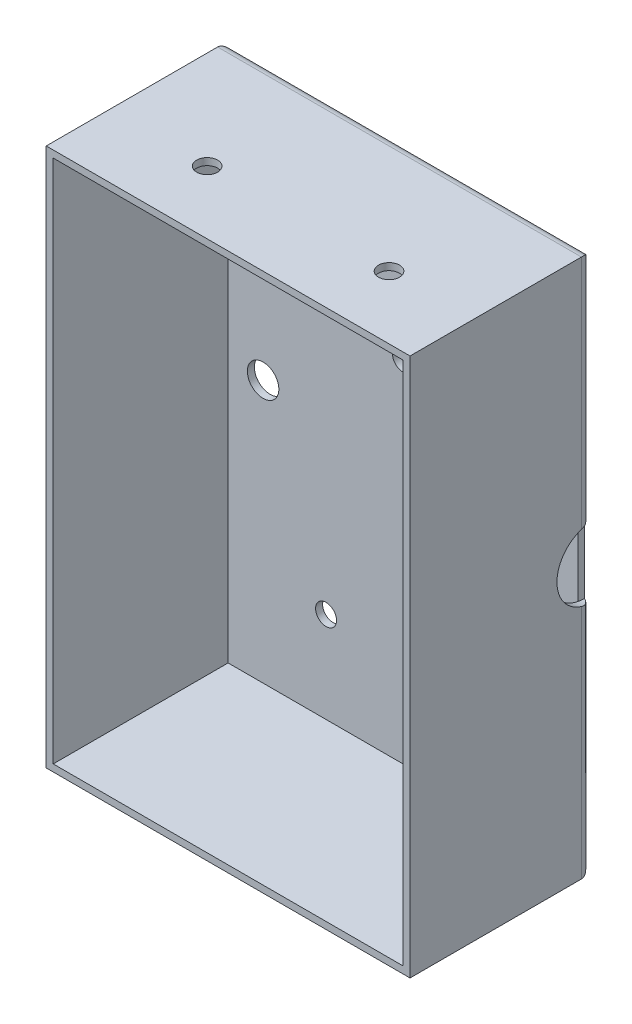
ISO-10303-21;
HEADER;
FILE_DESCRIPTION(('STEP AP214'),'2;1');
FILE_NAME('part.step','',(''),(''),'','','');
FILE_SCHEMA(('AUTOMOTIVE_DESIGN { 1 0 10303 214 1 1 1 1 }'));
ENDSEC;
DATA;
#1=APPLICATION_CONTEXT('core data for automotive mechanical design processes');
#2=APPLICATION_PROTOCOL_DEFINITION('international standard','automotive_design',2000,#1);
#3=PRODUCT_CONTEXT('',#1,'mechanical');
#4=PRODUCT('Part','Part','',(#3));
#5=PRODUCT_RELATED_PRODUCT_CATEGORY('part','',(#4));
#6=PRODUCT_DEFINITION_FORMATION('','',#4);
#7=PRODUCT_DEFINITION_CONTEXT('part definition',#1,'design');
#8=PRODUCT_DEFINITION('design','',#6,#7);
#9=PRODUCT_DEFINITION_SHAPE('','',#8);
#10=(LENGTH_UNIT() NAMED_UNIT(*) SI_UNIT(.MILLI.,.METRE.));
#11=(NAMED_UNIT(*) PLANE_ANGLE_UNIT() SI_UNIT($,.RADIAN.));
#12=(NAMED_UNIT(*) SI_UNIT($,.STERADIAN.) SOLID_ANGLE_UNIT());
#13=UNCERTAINTY_MEASURE_WITH_UNIT(LENGTH_MEASURE(1.E-05),#10,'distance_accuracy_value','');
#14=(GEOMETRIC_REPRESENTATION_CONTEXT(3) GLOBAL_UNCERTAINTY_ASSIGNED_CONTEXT((#13)) GLOBAL_UNIT_ASSIGNED_CONTEXT((#10,
#11,#12)) REPRESENTATION_CONTEXT('',''));
#15=CARTESIAN_POINT('',(0.,0.,0.));
#16=DIRECTION('',(0.,0.,1.));
#17=DIRECTION('',(1.,0.,0.));
#18=AXIS2_PLACEMENT_3D('',#15,#16,#17);
#19=CARTESIAN_POINT('',(0.,0.,26.));
#20=DIRECTION('',(1.,0.,0.));
#21=DIRECTION('',(0.,0.,-1.));
#22=AXIS2_PLACEMENT_3D('',#19,#20,#21);
#23=PLANE('',#22);
#24=DIRECTION('',(0.,0.,-1.));
#25=VECTOR('',#24,1.);
#26=CARTESIAN_POINT('',(0.,77.,26.));
#27=LINE('',#26,#25);
#28=CARTESIAN_POINT('',(0.,77.,26.));
#29=VERTEX_POINT('',#28);
#30=CARTESIAN_POINT('',(0.,77.,1.50000000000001));
#31=VERTEX_POINT('',#30);
#32=EDGE_CURVE('E360',#29,#31,#27,.T.);
#33=ORIENTED_EDGE('',*,*,#32,.T.);
#34=DIRECTION('',(0.,-1.,0.));
#35=VECTOR('',#34,1.);
#36=CARTESIAN_POINT('',(0.,0.,1.5));
#37=LINE('',#36,#35);
#38=CARTESIAN_POINT('',(0.,0.,1.50000000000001));
#39=VERTEX_POINT('',#38);
#40=EDGE_CURVE('E213',#31,#39,#37,.T.);
#41=ORIENTED_EDGE('',*,*,#40,.T.);
#42=DIRECTION('',(0.,0.,-1.));
#43=VECTOR('',#42,1.);
#44=CARTESIAN_POINT('',(0.,0.,26.));
#45=LINE('',#44,#43);
#46=CARTESIAN_POINT('',(0.,0.,26.));
#47=VERTEX_POINT('',#46);
#48=EDGE_CURVE('E393',#47,#39,#45,.T.);
#49=ORIENTED_EDGE('',*,*,#48,.F.);
#50=DIRECTION('',(0.,-1.,0.));
#51=VECTOR('',#50,1.);
#52=CARTESIAN_POINT('',(0.,0.,26.));
#53=LINE('',#52,#51);
#54=EDGE_CURVE('E366',#29,#47,#53,.T.);
#55=ORIENTED_EDGE('',*,*,#54,.F.);
#56=EDGE_LOOP('',(#33,#41,#49,#55));
#57=FACE_BOUND('',#56,.T.);
#58=ADVANCED_FACE('F36',(#57),#23,.F.);
#59=CARTESIAN_POINT('',(0.,0.,26.));
#60=DIRECTION('',(0.,1.,0.));
#61=DIRECTION('',(0.,0.,1.));
#62=AXIS2_PLACEMENT_3D('',#59,#60,#61);
#63=PLANE('',#62);
#64=ORIENTED_EDGE('',*,*,#48,.T.);
#65=DIRECTION('',(1.,0.,0.));
#66=VECTOR('',#65,1.);
#67=CARTESIAN_POINT('',(52.,0.,1.5));
#68=LINE('',#67,#66);
#69=CARTESIAN_POINT('',(52.,0.,1.50000000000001));
#70=VERTEX_POINT('',#69);
#71=EDGE_CURVE('E390',#39,#70,#68,.T.);
#72=ORIENTED_EDGE('',*,*,#71,.T.);
#73=DIRECTION('',(0.,0.,-1.));
#74=VECTOR('',#73,1.);
#75=CARTESIAN_POINT('',(52.,0.,26.));
#76=LINE('',#75,#74);
#77=CARTESIAN_POINT('',(52.,0.,26.));
#78=VERTEX_POINT('',#77);
#79=EDGE_CURVE('E396',#78,#70,#76,.T.);
#80=ORIENTED_EDGE('',*,*,#79,.F.);
#81=DIRECTION('',(1.,0.,0.));
#82=VECTOR('',#81,1.);
#83=CARTESIAN_POINT('',(0.,0.,26.));
#84=LINE('',#83,#82);
#85=EDGE_CURVE('E440',#47,#78,#84,.T.);
#86=ORIENTED_EDGE('',*,*,#85,.F.);
#87=EDGE_LOOP('',(#64,#72,#80,#86));
#88=FACE_BOUND('',#87,.T.);
#89=ADVANCED_FACE('F351',(#88),#63,.F.);
#90=CARTESIAN_POINT('',(52.,0.,26.));
#91=DIRECTION('',(-1.,0.,0.));
#92=DIRECTION('',(0.,0.,1.));
#93=AXIS2_PLACEMENT_3D('',#90,#91,#92);
#94=PLANE('',#93);
#95=DIRECTION('',(0.,1.,0.));
#96=VECTOR('',#95,1.);
#97=CARTESIAN_POINT('',(52.,77.,1.5));
#98=LINE('',#97,#96);
#99=CARTESIAN_POINT('',(52.,33.7303039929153,1.5));
#100=VERTEX_POINT('',#99);
#101=EDGE_CURVE('E197',#70,#100,#98,.T.);
#102=ORIENTED_EDGE('',*,*,#101,.T.);
#103=CARTESIAN_POINT('',(52.,38.5,0.));
#104=DIRECTION('',(1.,0.,0.));
#105=DIRECTION('',(0.,0.,1.));
#106=AXIS2_PLACEMENT_3D('',#103,#104,#105);
#107=CIRCLE('',#106,5.);
#108=CARTESIAN_POINT('',(52.,43.2696960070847,1.5));
#109=VERTEX_POINT('',#108);
#110=EDGE_CURVE('E183',#109,#100,#107,.T.);
#111=ORIENTED_EDGE('',*,*,#110,.F.);
#112=CARTESIAN_POINT('',(52.,77.,1.50000000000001));
#113=VERTEX_POINT('',#112);
#114=EDGE_CURVE('E193',#109,#113,#98,.T.);
#115=ORIENTED_EDGE('',*,*,#114,.T.);
#116=DIRECTION('',(0.,0.,-1.));
#117=VECTOR('',#116,1.);
#118=CARTESIAN_POINT('',(52.0000000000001,77.,26.));
#119=LINE('',#118,#117);
#120=CARTESIAN_POINT('',(52.0000000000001,77.,26.));
#121=VERTEX_POINT('',#120);
#122=EDGE_CURVE('E369',#121,#113,#119,.T.);
#123=ORIENTED_EDGE('',*,*,#122,.F.);
#124=DIRECTION('',(0.,1.,0.));
#125=VECTOR('',#124,1.);
#126=CARTESIAN_POINT('',(52.,0.,26.));
#127=LINE('',#126,#125);
#128=EDGE_CURVE('E442',#78,#121,#127,.T.);
#129=ORIENTED_EDGE('',*,*,#128,.F.);
#130=ORIENTED_EDGE('',*,*,#79,.T.);
#131=EDGE_LOOP('',(#102,#111,#115,#123,#129,#130));
#132=FACE_BOUND('',#131,.T.);
#133=ADVANCED_FACE('F191',(#132),#94,.F.);
#134=CARTESIAN_POINT('',(0.,77.,26.));
#135=DIRECTION('',(0.,-1.,0.));
#136=DIRECTION('',(0.,0.,-1.));
#137=AXIS2_PLACEMENT_3D('',#134,#135,#136);
#138=PLANE('',#137);
#139=CARTESIAN_POINT('',(14.,77.,17.));
#140=DIRECTION('',(0.,1.,0.));
#141=DIRECTION('',(0.,0.,1.));
#142=AXIS2_PLACEMENT_3D('',#139,#140,#141);
#143=CIRCLE('',#142,1.5);
#144=CARTESIAN_POINT('',(14.,77.,18.5));
#145=VERTEX_POINT('',#144);
#146=EDGE_CURVE('E626',#145,#145,#143,.T.);
#147=ORIENTED_EDGE('',*,*,#146,.F.);
#148=EDGE_LOOP('',(#147));
#149=FACE_BOUND('',#148,.T.);
#150=CARTESIAN_POINT('',(40.,77.,17.));
#151=DIRECTION('',(0.,1.,0.));
#152=DIRECTION('',(0.,0.,1.));
#153=AXIS2_PLACEMENT_3D('',#150,#151,#152);
#154=CIRCLE('',#153,1.5);
#155=CARTESIAN_POINT('',(40.,77.,18.5));
#156=VERTEX_POINT('',#155);
#157=EDGE_CURVE('E649',#156,#156,#154,.T.);
#158=ORIENTED_EDGE('',*,*,#157,.F.);
#159=EDGE_LOOP('',(#158));
#160=FACE_BOUND('',#159,.T.);
#161=ORIENTED_EDGE('',*,*,#122,.T.);
#162=DIRECTION('',(-1.,0.,0.));
#163=VECTOR('',#162,1.);
#164=CARTESIAN_POINT('',(0.,77.,1.5));
#165=LINE('',#164,#163);
#166=EDGE_CURVE('E206',#113,#31,#165,.T.);
#167=ORIENTED_EDGE('',*,*,#166,.T.);
#168=ORIENTED_EDGE('',*,*,#32,.F.);
#169=DIRECTION('',(-1.,0.,0.));
#170=VECTOR('',#169,1.);
#171=CARTESIAN_POINT('',(0.,77.,26.));
#172=LINE('',#171,#170);
#173=EDGE_CURVE('E370',#121,#29,#172,.T.);
#174=ORIENTED_EDGE('',*,*,#173,.F.);
#175=EDGE_LOOP('',(#161,#167,#168,#174));
#176=FACE_BOUND('',#175,.T.);
#177=ADVANCED_FACE('F448',(#149,#160,#176),#138,.F.);
#178=CARTESIAN_POINT('',(0.,77.,26.));
#179=DIRECTION('',(0.,0.,-1.));
#180=DIRECTION('',(-1.,0.,0.));
#181=AXIS2_PLACEMENT_3D('',#178,#179,#180);
#182=PLANE('',#181);
#183=DIRECTION('',(1.,0.,0.));
#184=VECTOR('',#183,1.);
#185=CARTESIAN_POINT('',(1.00000000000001,1.,26.));
#186=LINE('',#185,#184);
#187=CARTESIAN_POINT('',(1.00000000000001,1.,26.));
#188=VERTEX_POINT('',#187);
#189=CARTESIAN_POINT('',(51.,1.,26.));
#190=VERTEX_POINT('',#189);
#191=EDGE_CURVE('E408',#188,#190,#186,.T.);
#192=ORIENTED_EDGE('',*,*,#191,.F.);
#193=DIRECTION('',(0.,-1.,0.));
#194=VECTOR('',#193,1.);
#195=CARTESIAN_POINT('',(1.,76.,26.));
#196=LINE('',#195,#194);
#197=CARTESIAN_POINT('',(1.,76.,26.));
#198=VERTEX_POINT('',#197);
#199=EDGE_CURVE('E381',#198,#188,#196,.T.);
#200=ORIENTED_EDGE('',*,*,#199,.F.);
#201=DIRECTION('',(-1.,0.,0.));
#202=VECTOR('',#201,1.);
#203=CARTESIAN_POINT('',(1.,76.,26.));
#204=LINE('',#203,#202);
#205=CARTESIAN_POINT('',(51.0000000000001,76.,26.));
#206=VERTEX_POINT('',#205);
#207=EDGE_CURVE('E414',#206,#198,#204,.T.);
#208=ORIENTED_EDGE('',*,*,#207,.F.);
#209=DIRECTION('',(0.,1.,0.));
#210=VECTOR('',#209,1.);
#211=CARTESIAN_POINT('',(51.0000000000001,76.,26.));
#212=LINE('',#211,#210);
#213=EDGE_CURVE('E411',#190,#206,#212,.T.);
#214=ORIENTED_EDGE('',*,*,#213,.F.);
#215=EDGE_LOOP('',(#192,#200,#208,#214));
#216=FACE_BOUND('',#215,.T.);
#217=ORIENTED_EDGE('',*,*,#54,.T.);
#218=ORIENTED_EDGE('',*,*,#85,.T.);
#219=ORIENTED_EDGE('',*,*,#128,.T.);
#220=ORIENTED_EDGE('',*,*,#173,.T.);
#221=EDGE_LOOP('',(#217,#218,#219,#220));
#222=FACE_BOUND('',#221,.T.);
#223=ADVANCED_FACE('F447',(#216,#222),#182,.F.);
#224=CARTESIAN_POINT('',(0.,77.,0.));
#225=DIRECTION('',(0.,0.,-1.));
#226=DIRECTION('',(-1.,0.,0.));
#227=AXIS2_PLACEMENT_3D('',#224,#225,#226);
#228=PLANE('',#227);
#229=CARTESIAN_POINT('',(18.5,69.,0.));
#230=DIRECTION('',(0.,0.,-1.));
#231=DIRECTION('',(-1.,0.,0.));
#232=AXIS2_PLACEMENT_3D('',#229,#230,#231);
#233=CIRCLE('',#232,1.5);
#234=CARTESIAN_POINT('',(17.,68.9999999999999,0.));
#235=VERTEX_POINT('',#234);
#236=EDGE_CURVE('E262',#235,#235,#233,.T.);
#237=ORIENTED_EDGE('',*,*,#236,.F.);
#238=EDGE_LOOP('',(#237));
#239=FACE_BOUND('',#238,.T.);
#240=CARTESIAN_POINT('',(43.5,69.,0.));
#241=DIRECTION('',(0.,0.,-1.));
#242=DIRECTION('',(-1.,0.,0.));
#243=AXIS2_PLACEMENT_3D('',#240,#241,#242);
#244=CIRCLE('',#243,1.5);
#245=CARTESIAN_POINT('',(42.0000000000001,68.9999999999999,0.));
#246=VERTEX_POINT('',#245);
#247=EDGE_CURVE('E258',#246,#246,#244,.T.);
#248=ORIENTED_EDGE('',*,*,#247,.F.);
#249=EDGE_LOOP('',(#248));
#250=FACE_BOUND('',#249,.T.);
#251=CARTESIAN_POINT('',(23.624259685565,73.75,0.));
#252=DIRECTION('',(0.,0.,-1.));
#253=DIRECTION('',(1.,0.,0.));
#254=AXIS2_PLACEMENT_3D('',#251,#252,#253);
#255=CIRCLE('',#254,1.00000000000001);
#256=CARTESIAN_POINT('',(22.6332209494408,73.8835747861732,0.));
#257=VERTEX_POINT('',#256);
#258=CARTESIAN_POINT('',(23.624259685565,74.75,0.));
#259=VERTEX_POINT('',#258);
#260=EDGE_CURVE('E257',#257,#259,#255,.T.);
#261=ORIENTED_EDGE('',*,*,#260,.F.);
#262=DIRECTION('',(0.133574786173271,0.991038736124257,0.));
#263=VECTOR('',#262,1.);
#264=CARTESIAN_POINT('',(21.352786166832,64.3835747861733,0.));
#265=LINE('',#264,#263);
#266=CARTESIAN_POINT('',(21.352786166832,64.3835747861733,0.));
#267=VERTEX_POINT('',#266);
#268=EDGE_CURVE('E678',#267,#257,#265,.T.);
#269=ORIENTED_EDGE('',*,*,#268,.F.);
#270=CARTESIAN_POINT('',(22.3438249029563,64.25,0.));
#271=DIRECTION('',(0.,0.,-1.));
#272=DIRECTION('',(-1.,0.,0.));
#273=AXIS2_PLACEMENT_3D('',#270,#271,#272);
#274=CIRCLE('',#273,1.);
#275=CARTESIAN_POINT('',(22.3438249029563,63.25,0.));
#276=VERTEX_POINT('',#275);
#277=EDGE_CURVE('E675',#276,#267,#274,.T.);
#278=ORIENTED_EDGE('',*,*,#277,.F.);
#279=DIRECTION('',(-1.,0.,0.));
#280=VECTOR('',#279,1.);
#281=CARTESIAN_POINT('',(39.6561750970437,63.25,0.));
#282=LINE('',#281,#280);
#283=CARTESIAN_POINT('',(39.6561750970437,63.25,0.));
#284=VERTEX_POINT('',#283);
#285=EDGE_CURVE('E672',#284,#276,#282,.T.);
#286=ORIENTED_EDGE('',*,*,#285,.F.);
#287=CARTESIAN_POINT('',(39.6561750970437,64.25,0.));
#288=DIRECTION('',(0.,0.,-1.));
#289=DIRECTION('',(1.,0.,0.));
#290=AXIS2_PLACEMENT_3D('',#287,#288,#289);
#291=CIRCLE('',#290,1.);
#292=CARTESIAN_POINT('',(40.647213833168,64.3835747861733,0.));
#293=VERTEX_POINT('',#292);
#294=EDGE_CURVE('E669',#293,#284,#291,.T.);
#295=ORIENTED_EDGE('',*,*,#294,.F.);
#296=DIRECTION('',(0.133574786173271,-0.991038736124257,0.));
#297=VECTOR('',#296,1.);
#298=CARTESIAN_POINT('',(40.647213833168,64.3835747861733,0.));
#299=LINE('',#298,#297);
#300=CARTESIAN_POINT('',(39.3667790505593,73.8835747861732,0.));
#301=VERTEX_POINT('',#300);
#302=EDGE_CURVE('E666',#301,#293,#299,.T.);
#303=ORIENTED_EDGE('',*,*,#302,.F.);
#304=CARTESIAN_POINT('',(38.375740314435,73.75,0.));
#305=DIRECTION('',(0.,0.,-1.));
#306=DIRECTION('',(-1.,0.,0.));
#307=AXIS2_PLACEMENT_3D('',#304,#305,#306);
#308=CIRCLE('',#307,1.00000000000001);
#309=CARTESIAN_POINT('',(38.375740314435,74.75,0.));
#310=VERTEX_POINT('',#309);
#311=EDGE_CURVE('E663',#310,#301,#308,.T.);
#312=ORIENTED_EDGE('',*,*,#311,.F.);
#313=DIRECTION('',(1.,0.,0.));
#314=VECTOR('',#313,1.);
#315=CARTESIAN_POINT('',(38.375740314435,74.75,0.));
#316=LINE('',#315,#314);
#317=EDGE_CURVE('E660',#259,#310,#316,.T.);
#318=ORIENTED_EDGE('',*,*,#317,.F.);
#319=EDGE_LOOP('',(#261,#269,#278,#286,#295,#303,#312,#318));
#320=FACE_BOUND('',#319,.T.);
#321=CARTESIAN_POINT('',(26.,51.,0.));
#322=DIRECTION('',(0.,0.,-1.));
#323=DIRECTION('',(-1.,0.,0.));
#324=AXIS2_PLACEMENT_3D('',#321,#322,#323);
#325=CIRCLE('',#324,1.5);
#326=CARTESIAN_POINT('',(24.5000000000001,51.,0.));
#327=VERTEX_POINT('',#326);
#328=EDGE_CURVE('E237',#327,#327,#325,.T.);
#329=ORIENTED_EDGE('',*,*,#328,.F.);
#330=EDGE_LOOP('',(#329));
#331=FACE_BOUND('',#330,.T.);
#332=CARTESIAN_POINT('',(15.,14.,0.));
#333=DIRECTION('',(0.,0.,-1.));
#334=DIRECTION('',(-1.,0.,0.));
#335=AXIS2_PLACEMENT_3D('',#332,#333,#334);
#336=CIRCLE('',#335,1.5);
#337=CARTESIAN_POINT('',(13.5,14.,0.));
#338=VERTEX_POINT('',#337);
#339=EDGE_CURVE('E233',#338,#338,#336,.T.);
#340=ORIENTED_EDGE('',*,*,#339,.F.);
#341=EDGE_LOOP('',(#340));
#342=FACE_BOUND('',#341,.T.);
#343=CARTESIAN_POINT('',(37.,14.,0.));
#344=DIRECTION('',(0.,0.,-1.));
#345=DIRECTION('',(-1.,0.,0.));
#346=AXIS2_PLACEMENT_3D('',#343,#344,#345);
#347=CIRCLE('',#346,1.5);
#348=CARTESIAN_POINT('',(35.5,14.,0.));
#349=VERTEX_POINT('',#348);
#350=EDGE_CURVE('E229',#349,#349,#347,.T.);
#351=ORIENTED_EDGE('',*,*,#350,.F.);
#352=EDGE_LOOP('',(#351));
#353=FACE_BOUND('',#352,.T.);
#354=CARTESIAN_POINT('',(6.00000000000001,38.5,0.));
#355=DIRECTION('',(0.,0.,-1.));
#356=DIRECTION('',(-1.,0.,0.));
#357=AXIS2_PLACEMENT_3D('',#354,#355,#356);
#358=CIRCLE('',#357,2.25);
#359=CARTESIAN_POINT('',(3.75,38.5,0.));
#360=VERTEX_POINT('',#359);
#361=EDGE_CURVE('E225',#360,#360,#358,.T.);
#362=ORIENTED_EDGE('',*,*,#361,.F.);
#363=EDGE_LOOP('',(#362));
#364=FACE_BOUND('',#363,.T.);
#365=CARTESIAN_POINT('',(46.,38.5,0.));
#366=DIRECTION('',(0.,0.,-1.));
#367=DIRECTION('',(-1.,0.,0.));
#368=AXIS2_PLACEMENT_3D('',#365,#366,#367);
#369=CIRCLE('',#368,2.25);
#370=CARTESIAN_POINT('',(43.75,38.5,0.));
#371=VERTEX_POINT('',#370);
#372=EDGE_CURVE('E220',#371,#371,#369,.T.);
#373=ORIENTED_EDGE('',*,*,#372,.F.);
#374=EDGE_LOOP('',(#373));
#375=FACE_BOUND('',#374,.T.);
#376=DIRECTION('',(0.,1.,0.));
#377=VECTOR('',#376,1.);
#378=CARTESIAN_POINT('',(50.5,0.,0.));
#379=LINE('',#378,#377);
#380=CARTESIAN_POINT('',(50.5,75.5,0.));
#381=VERTEX_POINT('',#380);
#382=CARTESIAN_POINT('',(50.5,1.5,0.));
#383=VERTEX_POINT('',#382);
#384=EDGE_CURVE('E208',#381,#383,#379,.F.);
#385=ORIENTED_EDGE('',*,*,#384,.T.);
#386=DIRECTION('',(1.,0.,0.));
#387=VECTOR('',#386,1.);
#388=CARTESIAN_POINT('',(0.,1.5,0.));
#389=LINE('',#388,#387);
#390=CARTESIAN_POINT('',(1.5,1.5,0.));
#391=VERTEX_POINT('',#390);
#392=EDGE_CURVE('E204',#383,#391,#389,.F.);
#393=ORIENTED_EDGE('',*,*,#392,.T.);
#394=DIRECTION('',(0.,-1.,0.));
#395=VECTOR('',#394,1.);
#396=CARTESIAN_POINT('',(1.5,77.,0.));
#397=LINE('',#396,#395);
#398=CARTESIAN_POINT('',(1.5,75.5,0.));
#399=VERTEX_POINT('',#398);
#400=EDGE_CURVE('E386',#391,#399,#397,.F.);
#401=ORIENTED_EDGE('',*,*,#400,.T.);
#402=DIRECTION('',(-1.,0.,0.));
#403=VECTOR('',#402,1.);
#404=CARTESIAN_POINT('',(52.,75.5,0.));
#405=LINE('',#404,#403);
#406=EDGE_CURVE('E378',#399,#381,#405,.F.);
#407=ORIENTED_EDGE('',*,*,#406,.T.);
#408=EDGE_LOOP('',(#385,#393,#401,#407));
#409=FACE_BOUND('',#408,.T.);
#410=ADVANCED_FACE('F401',(#239,#250,#320,#331,#342,#353,#364,#375,#409),#228,.T.);
#411=CARTESIAN_POINT('',(1.,76.,1.));
#412=DIRECTION('',(-1.,0.,0.));
#413=DIRECTION('',(0.,-1.,0.));
#414=AXIS2_PLACEMENT_3D('',#411,#412,#413);
#415=PLANE('',#414);
#416=ORIENTED_EDGE('',*,*,#199,.T.);
#417=DIRECTION('',(0.,0.,1.));
#418=VECTOR('',#417,1.);
#419=CARTESIAN_POINT('',(1.00000000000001,1.,1.));
#420=LINE('',#419,#418);
#421=CARTESIAN_POINT('',(1.00000000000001,1.,1.));
#422=VERTEX_POINT('',#421);
#423=EDGE_CURVE('E430',#422,#188,#420,.T.);
#424=ORIENTED_EDGE('',*,*,#423,.F.);
#425=DIRECTION('',(0.,-1.,0.));
#426=VECTOR('',#425,1.);
#427=CARTESIAN_POINT('',(1.,76.,1.));
#428=LINE('',#427,#426);
#429=CARTESIAN_POINT('',(1.,76.,1.));
#430=VERTEX_POINT('',#429);
#431=EDGE_CURVE('E417',#430,#422,#428,.T.);
#432=ORIENTED_EDGE('',*,*,#431,.F.);
#433=DIRECTION('',(0.,0.,1.));
#434=VECTOR('',#433,1.);
#435=CARTESIAN_POINT('',(1.,76.,1.));
#436=LINE('',#435,#434);
#437=EDGE_CURVE('E431',#430,#198,#436,.T.);
#438=ORIENTED_EDGE('',*,*,#437,.T.);
#439=EDGE_LOOP('',(#416,#424,#432,#438));
#440=FACE_BOUND('',#439,.T.);
#441=ADVANCED_FACE('F464',(#440),#415,.F.);
#442=CARTESIAN_POINT('',(1.,76.,1.));
#443=DIRECTION('',(0.,1.,0.));
#444=DIRECTION('',(0.,0.,1.));
#445=AXIS2_PLACEMENT_3D('',#442,#443,#444);
#446=PLANE('',#445);
#447=CARTESIAN_POINT('',(14.,76.,17.));
#448=DIRECTION('',(0.,1.,0.));
#449=DIRECTION('',(0.,0.,1.));
#450=AXIS2_PLACEMENT_3D('',#447,#448,#449);
#451=CIRCLE('',#450,1.5);
#452=CARTESIAN_POINT('',(14.,76.,18.5));
#453=VERTEX_POINT('',#452);
#454=EDGE_CURVE('E646',#453,#453,#451,.F.);
#455=ORIENTED_EDGE('',*,*,#454,.F.);
#456=EDGE_LOOP('',(#455));
#457=FACE_BOUND('',#456,.T.);
#458=CARTESIAN_POINT('',(40.,76.,17.));
#459=DIRECTION('',(0.,1.,0.));
#460=DIRECTION('',(0.,0.,1.));
#461=AXIS2_PLACEMENT_3D('',#458,#459,#460);
#462=CIRCLE('',#461,1.5);
#463=CARTESIAN_POINT('',(40.,76.,18.5));
#464=VERTEX_POINT('',#463);
#465=EDGE_CURVE('E652',#464,#464,#462,.F.);
#466=ORIENTED_EDGE('',*,*,#465,.F.);
#467=EDGE_LOOP('',(#466));
#468=FACE_BOUND('',#467,.T.);
#469=ORIENTED_EDGE('',*,*,#207,.T.);
#470=ORIENTED_EDGE('',*,*,#437,.F.);
#471=DIRECTION('',(-1.,0.,0.));
#472=VECTOR('',#471,1.);
#473=CARTESIAN_POINT('',(1.,76.,1.));
#474=LINE('',#473,#472);
#475=CARTESIAN_POINT('',(51.,76.,1.));
#476=VERTEX_POINT('',#475);
#477=EDGE_CURVE('E427',#476,#430,#474,.T.);
#478=ORIENTED_EDGE('',*,*,#477,.F.);
#479=DIRECTION('',(0.,0.,1.));
#480=VECTOR('',#479,1.);
#481=CARTESIAN_POINT('',(51.,76.,1.));
#482=LINE('',#481,#480);
#483=EDGE_CURVE('E433',#476,#206,#482,.T.);
#484=ORIENTED_EDGE('',*,*,#483,.T.);
#485=EDGE_LOOP('',(#469,#470,#478,#484));
#486=FACE_BOUND('',#485,.T.);
#487=ADVANCED_FACE('F468',(#457,#468,#486),#446,.F.);
#488=CARTESIAN_POINT('',(51.,76.,1.));
#489=DIRECTION('',(1.,0.,0.));
#490=DIRECTION('',(0.,1.,0.));
#491=AXIS2_PLACEMENT_3D('',#488,#489,#490);
#492=PLANE('',#491);
#493=DIRECTION('',(0.,1.,0.));
#494=VECTOR('',#493,1.);
#495=CARTESIAN_POINT('',(51.,76.,1.));
#496=LINE('',#495,#494);
#497=CARTESIAN_POINT('',(51.,43.3989794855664,1.));
#498=VERTEX_POINT('',#497);
#499=EDGE_CURVE('E423',#498,#476,#496,.T.);
#500=ORIENTED_EDGE('',*,*,#499,.F.);
#501=CARTESIAN_POINT('',(51.,38.5,0.));
#502=DIRECTION('',(1.,0.,0.));
#503=DIRECTION('',(0.,0.,1.));
#504=AXIS2_PLACEMENT_3D('',#501,#502,#503);
#505=CIRCLE('',#504,5.);
#506=CARTESIAN_POINT('',(51.,33.6010205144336,1.));
#507=VERTEX_POINT('',#506);
#508=EDGE_CURVE('E629',#498,#507,#505,.T.);
#509=ORIENTED_EDGE('',*,*,#508,.T.);
#510=CARTESIAN_POINT('',(51.,1.,1.));
#511=VERTEX_POINT('',#510);
#512=EDGE_CURVE('E424',#511,#507,#496,.T.);
#513=ORIENTED_EDGE('',*,*,#512,.F.);
#514=DIRECTION('',(0.,0.,1.));
#515=VECTOR('',#514,1.);
#516=CARTESIAN_POINT('',(51.,1.,1.));
#517=LINE('',#516,#515);
#518=EDGE_CURVE('E435',#511,#190,#517,.T.);
#519=ORIENTED_EDGE('',*,*,#518,.T.);
#520=ORIENTED_EDGE('',*,*,#213,.T.);
#521=ORIENTED_EDGE('',*,*,#483,.F.);
#522=EDGE_LOOP('',(#500,#509,#513,#519,#520,#521));
#523=FACE_BOUND('',#522,.T.);
#524=ADVANCED_FACE('F474',(#523),#492,.F.);
#525=CARTESIAN_POINT('',(1.00000000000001,1.,1.));
#526=DIRECTION('',(0.,-1.,0.));
#527=DIRECTION('',(0.,0.,-1.));
#528=AXIS2_PLACEMENT_3D('',#525,#526,#527);
#529=PLANE('',#528);
#530=ORIENTED_EDGE('',*,*,#191,.T.);
#531=ORIENTED_EDGE('',*,*,#518,.F.);
#532=DIRECTION('',(1.,0.,0.));
#533=VECTOR('',#532,1.);
#534=CARTESIAN_POINT('',(1.00000000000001,1.,1.));
#535=LINE('',#534,#533);
#536=EDGE_CURVE('E420',#422,#511,#535,.T.);
#537=ORIENTED_EDGE('',*,*,#536,.F.);
#538=ORIENTED_EDGE('',*,*,#423,.T.);
#539=EDGE_LOOP('',(#530,#531,#537,#538));
#540=FACE_BOUND('',#539,.T.);
#541=ADVANCED_FACE('F470',(#540),#529,.F.);
#542=CARTESIAN_POINT('',(1.00000000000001,1.,1.));
#543=DIRECTION('',(0.,0.,1.));
#544=DIRECTION('',(1.,0.,0.));
#545=AXIS2_PLACEMENT_3D('',#542,#543,#544);
#546=PLANE('',#545);
#547=CARTESIAN_POINT('',(18.5,69.,1.));
#548=DIRECTION('',(0.,0.,1.));
#549=DIRECTION('',(1.,0.,0.));
#550=AXIS2_PLACEMENT_3D('',#547,#548,#549);
#551=CIRCLE('',#550,1.5);
#552=CARTESIAN_POINT('',(17.,68.9999999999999,0.999999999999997));
#553=VERTEX_POINT('',#552);
#554=EDGE_CURVE('E259',#553,#553,#551,.T.);
#555=ORIENTED_EDGE('',*,*,#554,.F.);
#556=EDGE_LOOP('',(#555));
#557=FACE_BOUND('',#556,.T.);
#558=CARTESIAN_POINT('',(43.5,69.,1.));
#559=DIRECTION('',(0.,0.,1.));
#560=DIRECTION('',(1.,0.,0.));
#561=AXIS2_PLACEMENT_3D('',#558,#559,#560);
#562=CIRCLE('',#561,1.5);
#563=CARTESIAN_POINT('',(42.0000000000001,68.9999999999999,0.999999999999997));
#564=VERTEX_POINT('',#563);
#565=EDGE_CURVE('E254',#564,#564,#562,.T.);
#566=ORIENTED_EDGE('',*,*,#565,.F.);
#567=EDGE_LOOP('',(#566));
#568=FACE_BOUND('',#567,.T.);
#569=CARTESIAN_POINT('',(23.624259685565,73.75,1.));
#570=DIRECTION('',(0.,0.,1.));
#571=DIRECTION('',(1.,0.,0.));
#572=AXIS2_PLACEMENT_3D('',#569,#570,#571);
#573=CIRCLE('',#572,1.00000000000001);
#574=CARTESIAN_POINT('',(23.624259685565,74.75,1.00000000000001));
#575=VERTEX_POINT('',#574);
#576=CARTESIAN_POINT('',(22.6332209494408,73.8835747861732,1.00000000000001));
#577=VERTEX_POINT('',#576);
#578=EDGE_CURVE('E252',#575,#577,#573,.T.);
#579=ORIENTED_EDGE('',*,*,#578,.F.);
#580=DIRECTION('',(-1.,0.,0.));
#581=VECTOR('',#580,1.);
#582=CARTESIAN_POINT('',(1.00000000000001,74.75,0.99999999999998));
#583=LINE('',#582,#581);
#584=CARTESIAN_POINT('',(38.375740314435,74.75,1.));
#585=VERTEX_POINT('',#584);
#586=EDGE_CURVE('E215',#585,#575,#583,.T.);
#587=ORIENTED_EDGE('',*,*,#586,.F.);
#588=CARTESIAN_POINT('',(38.375740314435,73.75,1.));
#589=DIRECTION('',(0.,0.,1.));
#590=DIRECTION('',(1.,0.,0.));
#591=AXIS2_PLACEMENT_3D('',#588,#589,#590);
#592=CIRCLE('',#591,1.00000000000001);
#593=CARTESIAN_POINT('',(39.3667790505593,73.8835747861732,1.));
#594=VERTEX_POINT('',#593);
#595=EDGE_CURVE('E239',#594,#585,#592,.T.);
#596=ORIENTED_EDGE('',*,*,#595,.F.);
#597=DIRECTION('',(-0.133574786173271,0.991038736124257,0.));
#598=VECTOR('',#597,1.);
#599=CARTESIAN_POINT('',(48.3303967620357,7.37931434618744,1.));
#600=LINE('',#599,#598);
#601=CARTESIAN_POINT('',(40.647213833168,64.3835747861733,1.00000000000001));
#602=VERTEX_POINT('',#601);
#603=EDGE_CURVE('E242',#602,#594,#600,.T.);
#604=ORIENTED_EDGE('',*,*,#603,.F.);
#605=CARTESIAN_POINT('',(39.6561750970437,64.25,1.));
#606=DIRECTION('',(0.,0.,1.));
#607=DIRECTION('',(1.,0.,0.));
#608=AXIS2_PLACEMENT_3D('',#605,#606,#607);
#609=CIRCLE('',#608,1.);
#610=CARTESIAN_POINT('',(39.6561750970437,63.25,1.00000000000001));
#611=VERTEX_POINT('',#610);
#612=EDGE_CURVE('E244',#611,#602,#609,.T.);
#613=ORIENTED_EDGE('',*,*,#612,.F.);
#614=DIRECTION('',(1.,0.,0.));
#615=VECTOR('',#614,1.);
#616=CARTESIAN_POINT('',(1.00000000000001,63.25,1.));
#617=LINE('',#616,#615);
#618=CARTESIAN_POINT('',(22.3438249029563,63.25,1.00000000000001));
#619=VERTEX_POINT('',#618);
#620=EDGE_CURVE('E246',#619,#611,#617,.T.);
#621=ORIENTED_EDGE('',*,*,#620,.F.);
#622=CARTESIAN_POINT('',(22.3438249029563,64.25,1.));
#623=DIRECTION('',(0.,0.,1.));
#624=DIRECTION('',(1.,0.,0.));
#625=AXIS2_PLACEMENT_3D('',#622,#623,#624);
#626=CIRCLE('',#625,1.);
#627=CARTESIAN_POINT('',(21.352786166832,64.3835747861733,1.00000000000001));
#628=VERTEX_POINT('',#627);
#629=EDGE_CURVE('E248',#628,#619,#626,.T.);
#630=ORIENTED_EDGE('',*,*,#629,.F.);
#631=DIRECTION('',(-0.133574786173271,-0.991038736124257,0.));
#632=VECTOR('',#631,1.);
#633=CARTESIAN_POINT('',(12.5990698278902,-0.563352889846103,1.));
#634=LINE('',#633,#632);
#635=EDGE_CURVE('E250',#577,#628,#634,.T.);
#636=ORIENTED_EDGE('',*,*,#635,.F.);
#637=EDGE_LOOP('',(#579,#587,#596,#604,#613,#621,#630,#636));
#638=FACE_BOUND('',#637,.T.);
#639=CARTESIAN_POINT('',(26.,51.,1.));
#640=DIRECTION('',(0.,0.,1.));
#641=DIRECTION('',(1.,0.,0.));
#642=AXIS2_PLACEMENT_3D('',#639,#640,#641);
#643=CIRCLE('',#642,1.5);
#644=CARTESIAN_POINT('',(24.5000000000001,51.,0.999999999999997));
#645=VERTEX_POINT('',#644);
#646=EDGE_CURVE('E234',#645,#645,#643,.T.);
#647=ORIENTED_EDGE('',*,*,#646,.F.);
#648=EDGE_LOOP('',(#647));
#649=FACE_BOUND('',#648,.T.);
#650=CARTESIAN_POINT('',(15.,14.,1.));
#651=DIRECTION('',(0.,0.,1.));
#652=DIRECTION('',(1.,0.,0.));
#653=AXIS2_PLACEMENT_3D('',#650,#651,#652);
#654=CIRCLE('',#653,1.5);
#655=CARTESIAN_POINT('',(13.5,14.,0.999999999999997));
#656=VERTEX_POINT('',#655);
#657=EDGE_CURVE('E230',#656,#656,#654,.T.);
#658=ORIENTED_EDGE('',*,*,#657,.F.);
#659=EDGE_LOOP('',(#658));
#660=FACE_BOUND('',#659,.T.);
#661=CARTESIAN_POINT('',(37.,14.,1.));
#662=DIRECTION('',(0.,0.,1.));
#663=DIRECTION('',(1.,0.,0.));
#664=AXIS2_PLACEMENT_3D('',#661,#662,#663);
#665=CIRCLE('',#664,1.5);
#666=CARTESIAN_POINT('',(35.5,14.,0.999999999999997));
#667=VERTEX_POINT('',#666);
#668=EDGE_CURVE('E226',#667,#667,#665,.T.);
#669=ORIENTED_EDGE('',*,*,#668,.F.);
#670=EDGE_LOOP('',(#669));
#671=FACE_BOUND('',#670,.T.);
#672=CARTESIAN_POINT('',(6.00000000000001,38.5,1.));
#673=DIRECTION('',(0.,0.,1.));
#674=DIRECTION('',(1.,0.,0.));
#675=AXIS2_PLACEMENT_3D('',#672,#673,#674);
#676=CIRCLE('',#675,2.25);
#677=CARTESIAN_POINT('',(3.75,38.5,0.999999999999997));
#678=VERTEX_POINT('',#677);
#679=EDGE_CURVE('E221',#678,#678,#676,.T.);
#680=ORIENTED_EDGE('',*,*,#679,.F.);
#681=EDGE_LOOP('',(#680));
#682=FACE_BOUND('',#681,.T.);
#683=CARTESIAN_POINT('',(46.,38.5,1.));
#684=DIRECTION('',(0.,0.,1.));
#685=DIRECTION('',(1.,0.,0.));
#686=AXIS2_PLACEMENT_3D('',#683,#684,#685);
#687=CIRCLE('',#686,2.25);
#688=CARTESIAN_POINT('',(43.75,38.5,0.999999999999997));
#689=VERTEX_POINT('',#688);
#690=EDGE_CURVE('E216',#689,#689,#687,.T.);
#691=ORIENTED_EDGE('',*,*,#690,.F.);
#692=EDGE_LOOP('',(#691));
#693=FACE_BOUND('',#692,.T.);
#694=ORIENTED_EDGE('',*,*,#431,.T.);
#695=ORIENTED_EDGE('',*,*,#536,.T.);
#696=ORIENTED_EDGE('',*,*,#512,.T.);
#697=DIRECTION('',(0.,-1.,0.));
#698=VECTOR('',#697,1.);
#699=CARTESIAN_POINT('',(51.,1.,1.));
#700=LINE('',#699,#698);
#701=EDGE_CURVE('E624',#498,#507,#700,.T.);
#702=ORIENTED_EDGE('',*,*,#701,.F.);
#703=ORIENTED_EDGE('',*,*,#499,.T.);
#704=ORIENTED_EDGE('',*,*,#477,.T.);
#705=EDGE_LOOP('',(#694,#695,#696,#702,#703,#704));
#706=FACE_BOUND('',#705,.T.);
#707=ADVANCED_FACE('F473',(#557,#568,#638,#649,#660,#671,#682,#693,#706),#546,.T.);
#708=CARTESIAN_POINT('',(0.,75.5,1.5));
#709=DIRECTION('',(1.,0.,0.));
#710=DIRECTION('',(0.,0.,-1.));
#711=AXIS2_PLACEMENT_3D('',#708,#709,#710);
#712=CYLINDRICAL_SURFACE('',#711,1.5);
#713=CARTESIAN_POINT('',(50.5,75.5,1.5));
#714=DIRECTION('',(0.707106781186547,-0.707106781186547,0.));
#715=DIRECTION('',(0.707106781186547,0.707106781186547,0.));
#716=AXIS2_PLACEMENT_3D('',#713,#714,#715);
#717=ELLIPSE('',#716,2.12132034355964,1.5);
#718=EDGE_CURVE('E203',#381,#113,#717,.T.);
#719=ORIENTED_EDGE('',*,*,#718,.F.);
#720=ORIENTED_EDGE('',*,*,#406,.F.);
#721=CARTESIAN_POINT('',(1.5,75.5,1.49999999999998));
#722=DIRECTION('',(0.707106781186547,0.707106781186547,0.));
#723=DIRECTION('',(-0.707106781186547,0.707106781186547,0.));
#724=AXIS2_PLACEMENT_3D('',#721,#722,#723);
#725=ELLIPSE('',#724,2.12132034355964,1.5);
#726=EDGE_CURVE('E376',#31,#399,#725,.F.);
#727=ORIENTED_EDGE('',*,*,#726,.F.);
#728=ORIENTED_EDGE('',*,*,#166,.F.);
#729=EDGE_LOOP('',(#719,#720,#727,#728));
#730=FACE_BOUND('',#729,.T.);
#731=ADVANCED_FACE('F377',(#730),#712,.T.);
#732=CARTESIAN_POINT('',(1.5,0.,1.5));
#733=DIRECTION('',(0.,1.,0.));
#734=DIRECTION('',(0.,0.,1.));
#735=AXIS2_PLACEMENT_3D('',#732,#733,#734);
#736=CYLINDRICAL_SURFACE('',#735,1.5);
#737=ORIENTED_EDGE('',*,*,#726,.T.);
#738=ORIENTED_EDGE('',*,*,#400,.F.);
#739=CARTESIAN_POINT('',(1.5,1.5,1.5));
#740=DIRECTION('',(-0.707106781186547,0.707106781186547,0.));
#741=DIRECTION('',(0.707106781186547,0.707106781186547,0.));
#742=AXIS2_PLACEMENT_3D('',#739,#740,#741);
#743=ELLIPSE('',#742,2.12132034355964,1.5);
#744=EDGE_CURVE('E384',#39,#391,#743,.F.);
#745=ORIENTED_EDGE('',*,*,#744,.F.);
#746=ORIENTED_EDGE('',*,*,#40,.F.);
#747=EDGE_LOOP('',(#737,#738,#745,#746));
#748=FACE_BOUND('',#747,.T.);
#749=ADVANCED_FACE('F349',(#748),#736,.T.);
#750=CARTESIAN_POINT('',(50.5,0.,1.5));
#751=DIRECTION('',(0.,-1.,0.));
#752=DIRECTION('',(0.,0.,-1.));
#753=AXIS2_PLACEMENT_3D('',#750,#751,#752);
#754=CYLINDRICAL_SURFACE('',#753,1.5);
#755=CARTESIAN_POINT('',(52.,33.7303039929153,1.50000000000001));
#756=CARTESIAN_POINT('',(51.9999996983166,33.7176954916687,1.45991570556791));
#757=CARTESIAN_POINT('',(51.9983918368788,33.7056021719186,1.41968512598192));
#758=CARTESIAN_POINT('',(51.9919006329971,33.6824927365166,1.33916980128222));
#759=CARTESIAN_POINT('',(51.9870165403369,33.67147686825,1.29888504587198));
#760=CARTESIAN_POINT('',(51.9673713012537,33.6401414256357,1.17840177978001));
#761=CARTESIAN_POINT('',(51.9476173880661,33.6215128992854,1.09850684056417));
#762=CARTESIAN_POINT('',(51.894837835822,33.5889032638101,0.942093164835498));
#763=CARTESIAN_POINT('',(51.8617883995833,33.5749305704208,0.865580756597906));
#764=CARTESIAN_POINT('',(51.783122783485,33.5513538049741,0.718635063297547));
#765=CARTESIAN_POINT('',(51.7375156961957,33.5417465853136,0.648197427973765));
#766=CARTESIAN_POINT('',(51.6361319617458,33.5263919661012,0.51719085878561));
#767=CARTESIAN_POINT('',(51.5806093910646,33.5205619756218,0.456434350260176));
#768=CARTESIAN_POINT('',(51.4602332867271,33.511581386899,0.344711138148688));
#769=CARTESIAN_POINT('',(51.3953778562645,33.5084313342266,0.293746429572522));
#770=CARTESIAN_POINT('',(51.2758689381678,33.5045011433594,0.214792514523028));
#771=CARTESIAN_POINT('',(51.2228822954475,33.503319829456,0.184265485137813));
#772=CARTESIAN_POINT('',(51.1136829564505,33.5016170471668,0.129921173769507));
#773=CARTESIAN_POINT('',(51.0574762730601,33.5010943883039,0.106091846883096));
#774=CARTESIAN_POINT('',(51.,33.5007359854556,0.0857864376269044));
#775=B_SPLINE_CURVE_WITH_KNOTS('',3,(#755,#756,#757,#758,#759,#760,#761,#762,#763,#764,#765,
#766,#767,#768,#769,#770,#771,#772,#773,#774),.UNSPECIFIED.,.F.,.F.,(4,2,2,2,2,2,2,2,2,4),(0.,
0.125994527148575,0.25201791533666,0.503855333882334,0.756145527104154,1.00825352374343,
1.25464430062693,1.50108522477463,1.68413645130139,1.8668563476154),.UNSPECIFIED.);
#776=CARTESIAN_POINT('',(51.,33.5007359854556,0.0857864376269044));
#777=VERTEX_POINT('',#776);
#778=EDGE_CURVE('E11',#100,#777,#775,.T.);
#779=ORIENTED_EDGE('',*,*,#778,.F.);
#780=ORIENTED_EDGE('',*,*,#101,.F.);
#781=CARTESIAN_POINT('',(50.5,1.5,1.5));
#782=DIRECTION('',(-0.707106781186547,-0.707106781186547,0.));
#783=DIRECTION('',(0.707106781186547,-0.707106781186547,0.));
#784=AXIS2_PLACEMENT_3D('',#781,#782,#783);
#785=ELLIPSE('',#784,2.12132034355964,1.5);
#786=EDGE_CURVE('E219',#383,#70,#785,.T.);
#787=ORIENTED_EDGE('',*,*,#786,.F.);
#788=ORIENTED_EDGE('',*,*,#384,.F.);
#789=ORIENTED_EDGE('',*,*,#718,.T.);
#790=ORIENTED_EDGE('',*,*,#114,.F.);
#791=CARTESIAN_POINT('',(51.,43.4992640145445,0.0857864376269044));
#792=CARTESIAN_POINT('',(51.0394255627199,43.4990224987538,0.0997257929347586));
#793=CARTESIAN_POINT('',(51.0782491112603,43.4986992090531,0.115307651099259));
#794=CARTESIAN_POINT('',(51.1544586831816,43.4977899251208,0.149654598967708));
#795=CARTESIAN_POINT('',(51.191844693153,43.4972039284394,0.168419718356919));
#796=CARTESIAN_POINT('',(51.3014465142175,43.4949041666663,0.229309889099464));
#797=CARTESIAN_POINT('',(51.3711591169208,43.4926485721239,0.276048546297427));
#798=CARTESIAN_POINT('',(51.5017867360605,43.4857796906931,0.380434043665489));
#799=CARTESIAN_POINT('',(51.5626944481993,43.48116446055,0.438089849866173));
#800=CARTESIAN_POINT('',(51.6738982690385,43.4686509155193,0.562496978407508));
#801=CARTESIAN_POINT('',(51.7242025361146,43.4607551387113,0.629241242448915));
#802=CARTESIAN_POINT('',(51.8123218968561,43.4410266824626,0.768870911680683));
#803=CARTESIAN_POINT('',(51.8502770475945,43.4292414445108,0.841674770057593));
#804=CARTESIAN_POINT('',(51.9136375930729,43.4012398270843,0.991802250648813));
#805=CARTESIAN_POINT('',(51.9390385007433,43.3850218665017,1.06912747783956));
#806=CARTESIAN_POINT('',(51.9720847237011,43.3528055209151,1.20576562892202));
#807=CARTESIAN_POINT('',(51.9826064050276,43.3378063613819,1.26464190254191));
#808=CARTESIAN_POINT('',(51.9965654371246,43.3054729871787,1.3824627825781));
#809=CARTESIAN_POINT('',(52.00001745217,43.2881436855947,1.44140699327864));
#810=CARTESIAN_POINT('',(52.,43.2696960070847,1.50000000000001));
#811=B_SPLINE_CURVE_WITH_KNOTS('',3,(#791,#792,#793,#794,#795,#796,#797,#798,#799,#800,#801,
#802,#803,#804,#805,#806,#807,#808,#809,#810),.UNSPECIFIED.,.F.,.F.,(4,2,2,2,2,2,2,2,2,4),(0.,
0.125377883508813,0.250756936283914,0.501348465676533,0.752146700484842,1.00275125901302,
1.25040557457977,1.49814834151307,1.68269687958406,1.86686222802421),.UNSPECIFIED.);
#812=CARTESIAN_POINT('',(51.,43.4992640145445,0.0857864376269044));
#813=VERTEX_POINT('',#812);
#814=EDGE_CURVE('E49',#813,#109,#811,.T.);
#815=ORIENTED_EDGE('',*,*,#814,.F.);
#816=DIRECTION('',(0.,-1.,0.));
#817=VECTOR('',#816,1.);
#818=CARTESIAN_POINT('',(51.,0.,0.0857864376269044));
#819=LINE('',#818,#817);
#820=EDGE_CURVE('E188',#777,#813,#819,.F.);
#821=ORIENTED_EDGE('',*,*,#820,.F.);
#822=EDGE_LOOP('',(#779,#780,#787,#788,#789,#790,#815,#821));
#823=FACE_BOUND('',#822,.T.);
#824=ADVANCED_FACE('F200',(#823),#754,.T.);
#825=CARTESIAN_POINT('',(0.,1.5,1.5));
#826=DIRECTION('',(-1.,0.,0.));
#827=DIRECTION('',(0.,0.,1.));
#828=AXIS2_PLACEMENT_3D('',#825,#826,#827);
#829=CYLINDRICAL_SURFACE('',#828,1.5);
#830=ORIENTED_EDGE('',*,*,#744,.T.);
#831=ORIENTED_EDGE('',*,*,#392,.F.);
#832=ORIENTED_EDGE('',*,*,#786,.T.);
#833=ORIENTED_EDGE('',*,*,#71,.F.);
#834=EDGE_LOOP('',(#830,#831,#832,#833));
#835=FACE_BOUND('',#834,.T.);
#836=ADVANCED_FACE('F342',(#835),#829,.T.);
#837=CARTESIAN_POINT('',(46.,38.5,26.));
#838=DIRECTION('',(0.,0.,-1.));
#839=DIRECTION('',(-1.,0.,0.));
#840=AXIS2_PLACEMENT_3D('',#837,#838,#839);
#841=CYLINDRICAL_SURFACE('',#840,2.25);
#842=CARTESIAN_POINT('',(43.75,38.5,0.999999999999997));
#843=CARTESIAN_POINT('',(43.75,38.5,0.989583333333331));
#844=CARTESIAN_POINT('',(43.75,38.5,0.979166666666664));
#845=CARTESIAN_POINT('',(43.75,38.5,0.958333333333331));
#846=CARTESIAN_POINT('',(43.75,38.5,0.947916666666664));
#847=CARTESIAN_POINT('',(43.75,38.5,0.927083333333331));
#848=CARTESIAN_POINT('',(43.75,38.5,0.916666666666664));
#849=CARTESIAN_POINT('',(43.75,38.5,0.895833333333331));
#850=CARTESIAN_POINT('',(43.75,38.5,0.885416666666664));
#851=CARTESIAN_POINT('',(43.75,38.5,0.864583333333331));
#852=CARTESIAN_POINT('',(43.75,38.5,0.854166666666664));
#853=CARTESIAN_POINT('',(43.75,38.5,0.833333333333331));
#854=CARTESIAN_POINT('',(43.75,38.5,0.822916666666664));
#855=CARTESIAN_POINT('',(43.75,38.5,0.802083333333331));
#856=CARTESIAN_POINT('',(43.75,38.5,0.791666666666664));
#857=CARTESIAN_POINT('',(43.75,38.5,0.77083333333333));
#858=CARTESIAN_POINT('',(43.75,38.5,0.760416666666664));
#859=CARTESIAN_POINT('',(43.75,38.5,0.73958333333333));
#860=CARTESIAN_POINT('',(43.75,38.5,0.729166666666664));
#861=CARTESIAN_POINT('',(43.75,38.5,0.70833333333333));
#862=CARTESIAN_POINT('',(43.75,38.5,0.697916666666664));
#863=CARTESIAN_POINT('',(43.75,38.5,0.67708333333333));
#864=CARTESIAN_POINT('',(43.75,38.5,0.666666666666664));
#865=CARTESIAN_POINT('',(43.75,38.5,0.64583333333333));
#866=CARTESIAN_POINT('',(43.75,38.5,0.635416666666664));
#867=CARTESIAN_POINT('',(43.75,38.5,0.61458333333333));
#868=CARTESIAN_POINT('',(43.75,38.5,0.604166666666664));
#869=CARTESIAN_POINT('',(43.75,38.5,0.58333333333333));
#870=CARTESIAN_POINT('',(43.75,38.5,0.572916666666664));
#871=CARTESIAN_POINT('',(43.75,38.5,0.55208333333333));
#872=CARTESIAN_POINT('',(43.75,38.5,0.541666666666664));
#873=CARTESIAN_POINT('',(43.75,38.5,0.52083333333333));
#874=CARTESIAN_POINT('',(43.75,38.5,0.510416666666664));
#875=CARTESIAN_POINT('',(43.75,38.5,0.48958333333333));
#876=CARTESIAN_POINT('',(43.75,38.5,0.479166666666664));
#877=CARTESIAN_POINT('',(43.75,38.5,0.45833333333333));
#878=CARTESIAN_POINT('',(43.75,38.5,0.447916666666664));
#879=CARTESIAN_POINT('',(43.75,38.5,0.42708333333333));
#880=CARTESIAN_POINT('',(43.75,38.5,0.416666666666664));
#881=CARTESIAN_POINT('',(43.75,38.5,0.39583333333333));
#882=CARTESIAN_POINT('',(43.75,38.5,0.385416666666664));
#883=CARTESIAN_POINT('',(43.75,38.5,0.36458333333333));
#884=CARTESIAN_POINT('',(43.75,38.5,0.354166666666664));
#885=CARTESIAN_POINT('',(43.75,38.5,0.33333333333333));
#886=CARTESIAN_POINT('',(43.75,38.5,0.322916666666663));
#887=CARTESIAN_POINT('',(43.75,38.5,0.30208333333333));
#888=CARTESIAN_POINT('',(43.75,38.5,0.291666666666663));
#889=CARTESIAN_POINT('',(43.75,38.5,0.27083333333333));
#890=CARTESIAN_POINT('',(43.75,38.5,0.260416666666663));
#891=CARTESIAN_POINT('',(43.75,38.5,0.23958333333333));
#892=CARTESIAN_POINT('',(43.75,38.5,0.229166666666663));
#893=CARTESIAN_POINT('',(43.75,38.5,0.20833333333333));
#894=CARTESIAN_POINT('',(43.75,38.5,0.197916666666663));
#895=CARTESIAN_POINT('',(43.75,38.5,0.17708333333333));
#896=CARTESIAN_POINT('',(43.75,38.5,0.166666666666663));
#897=CARTESIAN_POINT('',(43.75,38.5,0.14583333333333));
#898=CARTESIAN_POINT('',(43.75,38.5,0.135416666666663));
#899=CARTESIAN_POINT('',(43.75,38.5,0.11458333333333));
#900=CARTESIAN_POINT('',(43.75,38.5,0.104166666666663));
#901=CARTESIAN_POINT('',(43.75,38.5,0.0833333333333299));
#902=CARTESIAN_POINT('',(43.75,38.5,0.0729166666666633));
#903=CARTESIAN_POINT('',(43.75,38.5,0.0520833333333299));
#904=CARTESIAN_POINT('',(43.75,38.5,0.0416666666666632));
#905=CARTESIAN_POINT('',(43.75,38.5,0.0208333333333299));
#906=CARTESIAN_POINT('',(43.75,38.5,0.0104166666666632));
#907=CARTESIAN_POINT('',(43.75,38.5,0.));
#908=B_SPLINE_CURVE_WITH_KNOTS('',3,(#842,#843,#844,#845,#846,#847,#848,#849,#850,#851,#852,
#853,#854,#855,#856,#857,#858,#859,#860,#861,#862,#863,#864,#865,#866,#867,#868,#869,#870,#871,
#872,#873,#874,#875,#876,#877,#878,#879,#880,#881,#882,#883,#884,#885,#886,#887,#888,#889,#890,
#891,#892,#893,#894,#895,#896,#897,#898,#899,#900,#901,#902,#903,#904,#905,#906,#907),
.UNSPECIFIED.,.F.,.F.,(4,2,2,2,2,2,2,2,2,2,2,2,2,2,2,2,2,2,2,2,2,2,2,2,2,2,2,2,2,2,2,2,4),(0.,
0.03125,0.0625000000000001,0.0937500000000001,0.125,0.15625,0.1875,0.21875,0.25,0.28125,0.3125,
0.34375,0.375,0.40625,0.4375,0.46875,0.5,0.53125,0.5625,0.593750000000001,0.625000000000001,
0.656250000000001,0.687500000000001,0.718750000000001,0.750000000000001,0.781250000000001,
0.812500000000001,0.843750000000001,0.875000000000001,0.906250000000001,0.937500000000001,
0.968750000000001,1.),.UNSPECIFIED.);
#909=EDGE_CURVE('BSEAM339',#689,#371,#908,.T.);
#910=ORIENTED_EDGE('',*,*,#690,.T.);
#911=ORIENTED_EDGE('',*,*,#372,.T.);
#912=ORIENTED_EDGE('',*,*,#909,.T.);
#913=ORIENTED_EDGE('',*,*,#909,.F.);
#914=EDGE_LOOP('',(#910,#912,#911,#913));
#915=FACE_BOUND('',#914,.T.);
#916=ADVANCED_FACE('F339',(#915),#841,.F.);
#917=CARTESIAN_POINT('',(6.00000000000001,38.5,26.));
#918=DIRECTION('',(0.,0.,-1.));
#919=DIRECTION('',(-1.,0.,0.));
#920=AXIS2_PLACEMENT_3D('',#917,#918,#919);
#921=CYLINDRICAL_SURFACE('',#920,2.25);
#922=CARTESIAN_POINT('',(3.75,38.5,0.999999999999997));
#923=CARTESIAN_POINT('',(3.75,38.5,0.989583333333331));
#924=CARTESIAN_POINT('',(3.75,38.5,0.979166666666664));
#925=CARTESIAN_POINT('',(3.75,38.5,0.958333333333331));
#926=CARTESIAN_POINT('',(3.75,38.5,0.947916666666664));
#927=CARTESIAN_POINT('',(3.75,38.5,0.927083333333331));
#928=CARTESIAN_POINT('',(3.75,38.5,0.916666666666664));
#929=CARTESIAN_POINT('',(3.75,38.5,0.895833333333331));
#930=CARTESIAN_POINT('',(3.75,38.5,0.885416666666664));
#931=CARTESIAN_POINT('',(3.75,38.5,0.864583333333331));
#932=CARTESIAN_POINT('',(3.75,38.5,0.854166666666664));
#933=CARTESIAN_POINT('',(3.75,38.5,0.833333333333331));
#934=CARTESIAN_POINT('',(3.75,38.5,0.822916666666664));
#935=CARTESIAN_POINT('',(3.75,38.5,0.802083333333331));
#936=CARTESIAN_POINT('',(3.75,38.5,0.791666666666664));
#937=CARTESIAN_POINT('',(3.75,38.5,0.77083333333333));
#938=CARTESIAN_POINT('',(3.75,38.5,0.760416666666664));
#939=CARTESIAN_POINT('',(3.75,38.5,0.73958333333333));
#940=CARTESIAN_POINT('',(3.75,38.5,0.729166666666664));
#941=CARTESIAN_POINT('',(3.75,38.5,0.70833333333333));
#942=CARTESIAN_POINT('',(3.75,38.5,0.697916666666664));
#943=CARTESIAN_POINT('',(3.75,38.5,0.67708333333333));
#944=CARTESIAN_POINT('',(3.75,38.5,0.666666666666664));
#945=CARTESIAN_POINT('',(3.75,38.5,0.64583333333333));
#946=CARTESIAN_POINT('',(3.75,38.5,0.635416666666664));
#947=CARTESIAN_POINT('',(3.75,38.5,0.61458333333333));
#948=CARTESIAN_POINT('',(3.75,38.5,0.604166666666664));
#949=CARTESIAN_POINT('',(3.75,38.5,0.58333333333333));
#950=CARTESIAN_POINT('',(3.75,38.5,0.572916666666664));
#951=CARTESIAN_POINT('',(3.75,38.5,0.55208333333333));
#952=CARTESIAN_POINT('',(3.75,38.5,0.541666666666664));
#953=CARTESIAN_POINT('',(3.75,38.5,0.52083333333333));
#954=CARTESIAN_POINT('',(3.75,38.5,0.510416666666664));
#955=CARTESIAN_POINT('',(3.75,38.5,0.48958333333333));
#956=CARTESIAN_POINT('',(3.75,38.5,0.479166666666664));
#957=CARTESIAN_POINT('',(3.75,38.5,0.45833333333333));
#958=CARTESIAN_POINT('',(3.75,38.5,0.447916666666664));
#959=CARTESIAN_POINT('',(3.75,38.5,0.42708333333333));
#960=CARTESIAN_POINT('',(3.75,38.5,0.416666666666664));
#961=CARTESIAN_POINT('',(3.75,38.5,0.39583333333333));
#962=CARTESIAN_POINT('',(3.75,38.5,0.385416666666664));
#963=CARTESIAN_POINT('',(3.75,38.5,0.36458333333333));
#964=CARTESIAN_POINT('',(3.75,38.5,0.354166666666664));
#965=CARTESIAN_POINT('',(3.75,38.5,0.33333333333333));
#966=CARTESIAN_POINT('',(3.75,38.5,0.322916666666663));
#967=CARTESIAN_POINT('',(3.75,38.5,0.30208333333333));
#968=CARTESIAN_POINT('',(3.75,38.5,0.291666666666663));
#969=CARTESIAN_POINT('',(3.75,38.5,0.27083333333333));
#970=CARTESIAN_POINT('',(3.75,38.5,0.260416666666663));
#971=CARTESIAN_POINT('',(3.75,38.5,0.23958333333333));
#972=CARTESIAN_POINT('',(3.75,38.5,0.229166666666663));
#973=CARTESIAN_POINT('',(3.75,38.5,0.20833333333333));
#974=CARTESIAN_POINT('',(3.75,38.5,0.197916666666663));
#975=CARTESIAN_POINT('',(3.75,38.5,0.17708333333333));
#976=CARTESIAN_POINT('',(3.75,38.5,0.166666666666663));
#977=CARTESIAN_POINT('',(3.75,38.5,0.14583333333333));
#978=CARTESIAN_POINT('',(3.75,38.5,0.135416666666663));
#979=CARTESIAN_POINT('',(3.75,38.5,0.11458333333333));
#980=CARTESIAN_POINT('',(3.75,38.5,0.104166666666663));
#981=CARTESIAN_POINT('',(3.75,38.5,0.0833333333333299));
#982=CARTESIAN_POINT('',(3.75,38.5,0.0729166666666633));
#983=CARTESIAN_POINT('',(3.75,38.5,0.0520833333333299));
#984=CARTESIAN_POINT('',(3.75,38.5,0.0416666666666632));
#985=CARTESIAN_POINT('',(3.75,38.5,0.0208333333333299));
#986=CARTESIAN_POINT('',(3.75,38.5,0.0104166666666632));
#987=CARTESIAN_POINT('',(3.75,38.5,0.));
#988=B_SPLINE_CURVE_WITH_KNOTS('',3,(#922,#923,#924,#925,#926,#927,#928,#929,#930,#931,#932,
#933,#934,#935,#936,#937,#938,#939,#940,#941,#942,#943,#944,#945,#946,#947,#948,#949,#950,#951,
#952,#953,#954,#955,#956,#957,#958,#959,#960,#961,#962,#963,#964,#965,#966,#967,#968,#969,#970,
#971,#972,#973,#974,#975,#976,#977,#978,#979,#980,#981,#982,#983,#984,#985,#986,#987),
.UNSPECIFIED.,.F.,.F.,(4,2,2,2,2,2,2,2,2,2,2,2,2,2,2,2,2,2,2,2,2,2,2,2,2,2,2,2,2,2,2,2,4),(0.,
0.03125,0.0625000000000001,0.0937500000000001,0.125,0.15625,0.1875,0.21875,0.25,0.28125,0.3125,
0.34375,0.375,0.40625,0.4375,0.46875,0.5,0.53125,0.5625,0.593750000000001,0.625000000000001,
0.656250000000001,0.687500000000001,0.718750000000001,0.750000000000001,0.781250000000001,
0.812500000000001,0.843750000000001,0.875000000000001,0.906250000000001,0.937500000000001,
0.968750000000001,1.),.UNSPECIFIED.);
#989=EDGE_CURVE('BSEAM335',#678,#360,#988,.T.);
#990=ORIENTED_EDGE('',*,*,#679,.T.);
#991=ORIENTED_EDGE('',*,*,#361,.T.);
#992=ORIENTED_EDGE('',*,*,#989,.T.);
#993=ORIENTED_EDGE('',*,*,#989,.F.);
#994=EDGE_LOOP('',(#990,#992,#991,#993));
#995=FACE_BOUND('',#994,.T.);
#996=ADVANCED_FACE('F335',(#995),#921,.F.);
#997=CARTESIAN_POINT('',(37.,14.,26.));
#998=DIRECTION('',(0.,0.,-1.));
#999=DIRECTION('',(-1.,0.,0.));
#1000=AXIS2_PLACEMENT_3D('',#997,#998,#999);
#1001=CYLINDRICAL_SURFACE('',#1000,1.5);
#1002=CARTESIAN_POINT('',(35.5,14.,0.999999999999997));
#1003=CARTESIAN_POINT('',(35.5,14.,0.989583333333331));
#1004=CARTESIAN_POINT('',(35.5,14.,0.979166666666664));
#1005=CARTESIAN_POINT('',(35.5,14.,0.958333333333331));
#1006=CARTESIAN_POINT('',(35.5,14.,0.947916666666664));
#1007=CARTESIAN_POINT('',(35.5,14.,0.927083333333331));
#1008=CARTESIAN_POINT('',(35.5,14.,0.916666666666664));
#1009=CARTESIAN_POINT('',(35.5,14.,0.895833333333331));
#1010=CARTESIAN_POINT('',(35.5,14.,0.885416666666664));
#1011=CARTESIAN_POINT('',(35.5,14.,0.864583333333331));
#1012=CARTESIAN_POINT('',(35.5,14.,0.854166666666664));
#1013=CARTESIAN_POINT('',(35.5,14.,0.833333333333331));
#1014=CARTESIAN_POINT('',(35.5,14.,0.822916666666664));
#1015=CARTESIAN_POINT('',(35.5,14.,0.802083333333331));
#1016=CARTESIAN_POINT('',(35.5,14.,0.791666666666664));
#1017=CARTESIAN_POINT('',(35.5,14.,0.77083333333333));
#1018=CARTESIAN_POINT('',(35.5,14.,0.760416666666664));
#1019=CARTESIAN_POINT('',(35.5,14.,0.73958333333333));
#1020=CARTESIAN_POINT('',(35.5,14.,0.729166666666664));
#1021=CARTESIAN_POINT('',(35.5,14.,0.70833333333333));
#1022=CARTESIAN_POINT('',(35.5,14.,0.697916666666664));
#1023=CARTESIAN_POINT('',(35.5,14.,0.67708333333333));
#1024=CARTESIAN_POINT('',(35.5,14.,0.666666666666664));
#1025=CARTESIAN_POINT('',(35.5,14.,0.64583333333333));
#1026=CARTESIAN_POINT('',(35.5,14.,0.635416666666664));
#1027=CARTESIAN_POINT('',(35.5,14.,0.61458333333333));
#1028=CARTESIAN_POINT('',(35.5,14.,0.604166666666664));
#1029=CARTESIAN_POINT('',(35.5,14.,0.58333333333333));
#1030=CARTESIAN_POINT('',(35.5,14.,0.572916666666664));
#1031=CARTESIAN_POINT('',(35.5,14.,0.55208333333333));
#1032=CARTESIAN_POINT('',(35.5,14.,0.541666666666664));
#1033=CARTESIAN_POINT('',(35.5,14.,0.52083333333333));
#1034=CARTESIAN_POINT('',(35.5,14.,0.510416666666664));
#1035=CARTESIAN_POINT('',(35.5,14.,0.48958333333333));
#1036=CARTESIAN_POINT('',(35.5,14.,0.479166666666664));
#1037=CARTESIAN_POINT('',(35.5,14.,0.45833333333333));
#1038=CARTESIAN_POINT('',(35.5,14.,0.447916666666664));
#1039=CARTESIAN_POINT('',(35.5,14.,0.42708333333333));
#1040=CARTESIAN_POINT('',(35.5,14.,0.416666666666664));
#1041=CARTESIAN_POINT('',(35.5,14.,0.39583333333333));
#1042=CARTESIAN_POINT('',(35.5,14.,0.385416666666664));
#1043=CARTESIAN_POINT('',(35.5,14.,0.36458333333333));
#1044=CARTESIAN_POINT('',(35.5,14.,0.354166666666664));
#1045=CARTESIAN_POINT('',(35.5,14.,0.33333333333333));
#1046=CARTESIAN_POINT('',(35.5,14.,0.322916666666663));
#1047=CARTESIAN_POINT('',(35.5,14.,0.30208333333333));
#1048=CARTESIAN_POINT('',(35.5,14.,0.291666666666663));
#1049=CARTESIAN_POINT('',(35.5,14.,0.27083333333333));
#1050=CARTESIAN_POINT('',(35.5,14.,0.260416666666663));
#1051=CARTESIAN_POINT('',(35.5,14.,0.23958333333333));
#1052=CARTESIAN_POINT('',(35.5,14.,0.229166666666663));
#1053=CARTESIAN_POINT('',(35.5,14.,0.20833333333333));
#1054=CARTESIAN_POINT('',(35.5,14.,0.197916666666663));
#1055=CARTESIAN_POINT('',(35.5,14.,0.17708333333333));
#1056=CARTESIAN_POINT('',(35.5,14.,0.166666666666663));
#1057=CARTESIAN_POINT('',(35.5,14.,0.14583333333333));
#1058=CARTESIAN_POINT('',(35.5,14.,0.135416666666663));
#1059=CARTESIAN_POINT('',(35.5,14.,0.11458333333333));
#1060=CARTESIAN_POINT('',(35.5,14.,0.104166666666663));
#1061=CARTESIAN_POINT('',(35.5,14.,0.0833333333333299));
#1062=CARTESIAN_POINT('',(35.5,14.,0.0729166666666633));
#1063=CARTESIAN_POINT('',(35.5,14.,0.0520833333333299));
#1064=CARTESIAN_POINT('',(35.5,14.,0.0416666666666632));
#1065=CARTESIAN_POINT('',(35.5,14.,0.0208333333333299));
#1066=CARTESIAN_POINT('',(35.5,14.,0.0104166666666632));
#1067=CARTESIAN_POINT('',(35.5,14.,0.));
#1068=B_SPLINE_CURVE_WITH_KNOTS('',3,(#1002,#1003,#1004,#1005,#1006,#1007,#1008,#1009,#1010,
#1011,#1012,#1013,#1014,#1015,#1016,#1017,#1018,#1019,#1020,#1021,#1022,#1023,#1024,#1025,#1026,
#1027,#1028,#1029,#1030,#1031,#1032,#1033,#1034,#1035,#1036,#1037,#1038,#1039,#1040,#1041,#1042,
#1043,#1044,#1045,#1046,#1047,#1048,#1049,#1050,#1051,#1052,#1053,#1054,#1055,#1056,#1057,#1058,
#1059,#1060,#1061,#1062,#1063,#1064,#1065,#1066,#1067),.UNSPECIFIED.,.F.,.F.,(4,2,2,2,2,2,2,2,2,
2,2,2,2,2,2,2,2,2,2,2,2,2,2,2,2,2,2,2,2,2,2,2,4),(0.,0.03125,0.0625000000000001,
0.0937500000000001,0.125,0.15625,0.1875,0.21875,0.25,0.28125,0.3125,0.34375,0.375,0.40625,
0.4375,0.46875,0.5,0.53125,0.5625,0.593750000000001,0.625000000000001,0.656250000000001,
0.687500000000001,0.718750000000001,0.750000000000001,0.781250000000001,0.812500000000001,
0.843750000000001,0.875000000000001,0.906250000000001,0.937500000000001,0.968750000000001,1.),.UNSPECIFIED.);
#1069=EDGE_CURVE('BSEAM331',#667,#349,#1068,.T.);
#1070=ORIENTED_EDGE('',*,*,#668,.T.);
#1071=ORIENTED_EDGE('',*,*,#350,.T.);
#1072=ORIENTED_EDGE('',*,*,#1069,.T.);
#1073=ORIENTED_EDGE('',*,*,#1069,.F.);
#1074=EDGE_LOOP('',(#1070,#1072,#1071,#1073));
#1075=FACE_BOUND('',#1074,.T.);
#1076=ADVANCED_FACE('F331',(#1075),#1001,.F.);
#1077=CARTESIAN_POINT('',(15.,14.,26.));
#1078=DIRECTION('',(0.,0.,-1.));
#1079=DIRECTION('',(-1.,0.,0.));
#1080=AXIS2_PLACEMENT_3D('',#1077,#1078,#1079);
#1081=CYLINDRICAL_SURFACE('',#1080,1.5);
#1082=CARTESIAN_POINT('',(13.5,14.,0.999999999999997));
#1083=CARTESIAN_POINT('',(13.5,14.,0.989583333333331));
#1084=CARTESIAN_POINT('',(13.5,14.,0.979166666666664));
#1085=CARTESIAN_POINT('',(13.5,14.,0.958333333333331));
#1086=CARTESIAN_POINT('',(13.5,14.,0.947916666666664));
#1087=CARTESIAN_POINT('',(13.5,14.,0.927083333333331));
#1088=CARTESIAN_POINT('',(13.5,14.,0.916666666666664));
#1089=CARTESIAN_POINT('',(13.5,14.,0.895833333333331));
#1090=CARTESIAN_POINT('',(13.5,14.,0.885416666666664));
#1091=CARTESIAN_POINT('',(13.5,14.,0.864583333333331));
#1092=CARTESIAN_POINT('',(13.5,14.,0.854166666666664));
#1093=CARTESIAN_POINT('',(13.5,14.,0.833333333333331));
#1094=CARTESIAN_POINT('',(13.5,14.,0.822916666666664));
#1095=CARTESIAN_POINT('',(13.5,14.,0.802083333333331));
#1096=CARTESIAN_POINT('',(13.5,14.,0.791666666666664));
#1097=CARTESIAN_POINT('',(13.5,14.,0.77083333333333));
#1098=CARTESIAN_POINT('',(13.5,14.,0.760416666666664));
#1099=CARTESIAN_POINT('',(13.5,14.,0.73958333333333));
#1100=CARTESIAN_POINT('',(13.5,14.,0.729166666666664));
#1101=CARTESIAN_POINT('',(13.5,14.,0.70833333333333));
#1102=CARTESIAN_POINT('',(13.5,14.,0.697916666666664));
#1103=CARTESIAN_POINT('',(13.5,14.,0.67708333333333));
#1104=CARTESIAN_POINT('',(13.5,14.,0.666666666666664));
#1105=CARTESIAN_POINT('',(13.5,14.,0.64583333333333));
#1106=CARTESIAN_POINT('',(13.5,14.,0.635416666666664));
#1107=CARTESIAN_POINT('',(13.5,14.,0.61458333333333));
#1108=CARTESIAN_POINT('',(13.5,14.,0.604166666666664));
#1109=CARTESIAN_POINT('',(13.5,14.,0.58333333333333));
#1110=CARTESIAN_POINT('',(13.5,14.,0.572916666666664));
#1111=CARTESIAN_POINT('',(13.5,14.,0.55208333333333));
#1112=CARTESIAN_POINT('',(13.5,14.,0.541666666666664));
#1113=CARTESIAN_POINT('',(13.5,14.,0.52083333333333));
#1114=CARTESIAN_POINT('',(13.5,14.,0.510416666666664));
#1115=CARTESIAN_POINT('',(13.5,14.,0.48958333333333));
#1116=CARTESIAN_POINT('',(13.5,14.,0.479166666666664));
#1117=CARTESIAN_POINT('',(13.5,14.,0.45833333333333));
#1118=CARTESIAN_POINT('',(13.5,14.,0.447916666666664));
#1119=CARTESIAN_POINT('',(13.5,14.,0.42708333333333));
#1120=CARTESIAN_POINT('',(13.5,14.,0.416666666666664));
#1121=CARTESIAN_POINT('',(13.5,14.,0.39583333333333));
#1122=CARTESIAN_POINT('',(13.5,14.,0.385416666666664));
#1123=CARTESIAN_POINT('',(13.5,14.,0.36458333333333));
#1124=CARTESIAN_POINT('',(13.5,14.,0.354166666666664));
#1125=CARTESIAN_POINT('',(13.5,14.,0.33333333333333));
#1126=CARTESIAN_POINT('',(13.5,14.,0.322916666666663));
#1127=CARTESIAN_POINT('',(13.5,14.,0.30208333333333));
#1128=CARTESIAN_POINT('',(13.5,14.,0.291666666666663));
#1129=CARTESIAN_POINT('',(13.5,14.,0.27083333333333));
#1130=CARTESIAN_POINT('',(13.5,14.,0.260416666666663));
#1131=CARTESIAN_POINT('',(13.5,14.,0.23958333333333));
#1132=CARTESIAN_POINT('',(13.5,14.,0.229166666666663));
#1133=CARTESIAN_POINT('',(13.5,14.,0.20833333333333));
#1134=CARTESIAN_POINT('',(13.5,14.,0.197916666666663));
#1135=CARTESIAN_POINT('',(13.5,14.,0.17708333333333));
#1136=CARTESIAN_POINT('',(13.5,14.,0.166666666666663));
#1137=CARTESIAN_POINT('',(13.5,14.,0.14583333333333));
#1138=CARTESIAN_POINT('',(13.5,14.,0.135416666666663));
#1139=CARTESIAN_POINT('',(13.5,14.,0.11458333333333));
#1140=CARTESIAN_POINT('',(13.5,14.,0.104166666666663));
#1141=CARTESIAN_POINT('',(13.5,14.,0.0833333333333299));
#1142=CARTESIAN_POINT('',(13.5,14.,0.0729166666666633));
#1143=CARTESIAN_POINT('',(13.5,14.,0.0520833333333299));
#1144=CARTESIAN_POINT('',(13.5,14.,0.0416666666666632));
#1145=CARTESIAN_POINT('',(13.5,14.,0.0208333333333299));
#1146=CARTESIAN_POINT('',(13.5,14.,0.0104166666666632));
#1147=CARTESIAN_POINT('',(13.5,14.,0.));
#1148=B_SPLINE_CURVE_WITH_KNOTS('',3,(#1082,#1083,#1084,#1085,#1086,#1087,#1088,#1089,#1090,
#1091,#1092,#1093,#1094,#1095,#1096,#1097,#1098,#1099,#1100,#1101,#1102,#1103,#1104,#1105,#1106,
#1107,#1108,#1109,#1110,#1111,#1112,#1113,#1114,#1115,#1116,#1117,#1118,#1119,#1120,#1121,#1122,
#1123,#1124,#1125,#1126,#1127,#1128,#1129,#1130,#1131,#1132,#1133,#1134,#1135,#1136,#1137,#1138,
#1139,#1140,#1141,#1142,#1143,#1144,#1145,#1146,#1147),.UNSPECIFIED.,.F.,.F.,(4,2,2,2,2,2,2,2,2,
2,2,2,2,2,2,2,2,2,2,2,2,2,2,2,2,2,2,2,2,2,2,2,4),(0.,0.03125,0.0625000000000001,
0.0937500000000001,0.125,0.15625,0.1875,0.21875,0.25,0.28125,0.3125,0.34375,0.375,0.40625,
0.4375,0.46875,0.5,0.53125,0.5625,0.593750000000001,0.625000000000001,0.656250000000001,
0.687500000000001,0.718750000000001,0.750000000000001,0.781250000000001,0.812500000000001,
0.843750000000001,0.875000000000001,0.906250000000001,0.937500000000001,0.968750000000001,1.),.UNSPECIFIED.);
#1149=EDGE_CURVE('BSEAM327',#656,#338,#1148,.T.);
#1150=ORIENTED_EDGE('',*,*,#657,.T.);
#1151=ORIENTED_EDGE('',*,*,#339,.T.);
#1152=ORIENTED_EDGE('',*,*,#1149,.T.);
#1153=ORIENTED_EDGE('',*,*,#1149,.F.);
#1154=EDGE_LOOP('',(#1150,#1152,#1151,#1153));
#1155=FACE_BOUND('',#1154,.T.);
#1156=ADVANCED_FACE('F327',(#1155),#1081,.F.);
#1157=CARTESIAN_POINT('',(26.0000000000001,51.,26.));
#1158=DIRECTION('',(0.,0.,-1.));
#1159=DIRECTION('',(-1.,0.,0.));
#1160=AXIS2_PLACEMENT_3D('',#1157,#1158,#1159);
#1161=CYLINDRICAL_SURFACE('',#1160,1.5);
#1162=CARTESIAN_POINT('',(24.5000000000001,51.,0.999999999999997));
#1163=CARTESIAN_POINT('',(24.5000000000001,51.,0.989583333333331));
#1164=CARTESIAN_POINT('',(24.5000000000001,51.,0.979166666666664));
#1165=CARTESIAN_POINT('',(24.5000000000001,51.,0.958333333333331));
#1166=CARTESIAN_POINT('',(24.5000000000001,51.,0.947916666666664));
#1167=CARTESIAN_POINT('',(24.5000000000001,51.,0.927083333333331));
#1168=CARTESIAN_POINT('',(24.5000000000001,51.,0.916666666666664));
#1169=CARTESIAN_POINT('',(24.5000000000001,51.,0.895833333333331));
#1170=CARTESIAN_POINT('',(24.5000000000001,51.,0.885416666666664));
#1171=CARTESIAN_POINT('',(24.5000000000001,51.,0.864583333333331));
#1172=CARTESIAN_POINT('',(24.5000000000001,51.,0.854166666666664));
#1173=CARTESIAN_POINT('',(24.5000000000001,51.,0.833333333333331));
#1174=CARTESIAN_POINT('',(24.5000000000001,51.,0.822916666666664));
#1175=CARTESIAN_POINT('',(24.5000000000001,51.,0.802083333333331));
#1176=CARTESIAN_POINT('',(24.5000000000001,51.,0.791666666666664));
#1177=CARTESIAN_POINT('',(24.5000000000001,51.,0.77083333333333));
#1178=CARTESIAN_POINT('',(24.5000000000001,51.,0.760416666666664));
#1179=CARTESIAN_POINT('',(24.5000000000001,51.,0.73958333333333));
#1180=CARTESIAN_POINT('',(24.5000000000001,51.,0.729166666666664));
#1181=CARTESIAN_POINT('',(24.5000000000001,51.,0.70833333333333));
#1182=CARTESIAN_POINT('',(24.5000000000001,51.,0.697916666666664));
#1183=CARTESIAN_POINT('',(24.5000000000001,51.,0.67708333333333));
#1184=CARTESIAN_POINT('',(24.5000000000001,51.,0.666666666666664));
#1185=CARTESIAN_POINT('',(24.5000000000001,51.,0.64583333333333));
#1186=CARTESIAN_POINT('',(24.5000000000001,51.,0.635416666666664));
#1187=CARTESIAN_POINT('',(24.5000000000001,51.,0.61458333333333));
#1188=CARTESIAN_POINT('',(24.5000000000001,51.,0.604166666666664));
#1189=CARTESIAN_POINT('',(24.5000000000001,51.,0.58333333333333));
#1190=CARTESIAN_POINT('',(24.5000000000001,51.,0.572916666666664));
#1191=CARTESIAN_POINT('',(24.5000000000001,51.,0.55208333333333));
#1192=CARTESIAN_POINT('',(24.5000000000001,51.,0.541666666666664));
#1193=CARTESIAN_POINT('',(24.5000000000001,51.,0.52083333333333));
#1194=CARTESIAN_POINT('',(24.5000000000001,51.,0.510416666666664));
#1195=CARTESIAN_POINT('',(24.5000000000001,51.,0.48958333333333));
#1196=CARTESIAN_POINT('',(24.5000000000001,51.,0.479166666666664));
#1197=CARTESIAN_POINT('',(24.5000000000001,51.,0.45833333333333));
#1198=CARTESIAN_POINT('',(24.5000000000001,51.,0.447916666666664));
#1199=CARTESIAN_POINT('',(24.5000000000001,51.,0.42708333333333));
#1200=CARTESIAN_POINT('',(24.5000000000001,51.,0.416666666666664));
#1201=CARTESIAN_POINT('',(24.5000000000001,51.,0.39583333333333));
#1202=CARTESIAN_POINT('',(24.5000000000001,51.,0.385416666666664));
#1203=CARTESIAN_POINT('',(24.5000000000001,51.,0.36458333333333));
#1204=CARTESIAN_POINT('',(24.5000000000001,51.,0.354166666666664));
#1205=CARTESIAN_POINT('',(24.5000000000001,51.,0.33333333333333));
#1206=CARTESIAN_POINT('',(24.5000000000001,51.,0.322916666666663));
#1207=CARTESIAN_POINT('',(24.5000000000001,51.,0.30208333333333));
#1208=CARTESIAN_POINT('',(24.5000000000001,51.,0.291666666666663));
#1209=CARTESIAN_POINT('',(24.5000000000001,51.,0.27083333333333));
#1210=CARTESIAN_POINT('',(24.5000000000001,51.,0.260416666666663));
#1211=CARTESIAN_POINT('',(24.5000000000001,51.,0.23958333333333));
#1212=CARTESIAN_POINT('',(24.5000000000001,51.,0.229166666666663));
#1213=CARTESIAN_POINT('',(24.5000000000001,51.,0.20833333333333));
#1214=CARTESIAN_POINT('',(24.5000000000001,51.,0.197916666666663));
#1215=CARTESIAN_POINT('',(24.5000000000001,51.,0.17708333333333));
#1216=CARTESIAN_POINT('',(24.5000000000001,51.,0.166666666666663));
#1217=CARTESIAN_POINT('',(24.5000000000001,51.,0.14583333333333));
#1218=CARTESIAN_POINT('',(24.5000000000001,51.,0.135416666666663));
#1219=CARTESIAN_POINT('',(24.5000000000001,51.,0.11458333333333));
#1220=CARTESIAN_POINT('',(24.5000000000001,51.,0.104166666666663));
#1221=CARTESIAN_POINT('',(24.5000000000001,51.,0.0833333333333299));
#1222=CARTESIAN_POINT('',(24.5000000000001,51.,0.0729166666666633));
#1223=CARTESIAN_POINT('',(24.5000000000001,51.,0.0520833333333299));
#1224=CARTESIAN_POINT('',(24.5000000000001,51.,0.0416666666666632));
#1225=CARTESIAN_POINT('',(24.5000000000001,51.,0.0208333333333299));
#1226=CARTESIAN_POINT('',(24.5000000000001,51.,0.0104166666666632));
#1227=CARTESIAN_POINT('',(24.5000000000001,51.,0.));
#1228=B_SPLINE_CURVE_WITH_KNOTS('',3,(#1162,#1163,#1164,#1165,#1166,#1167,#1168,#1169,#1170,
#1171,#1172,#1173,#1174,#1175,#1176,#1177,#1178,#1179,#1180,#1181,#1182,#1183,#1184,#1185,#1186,
#1187,#1188,#1189,#1190,#1191,#1192,#1193,#1194,#1195,#1196,#1197,#1198,#1199,#1200,#1201,#1202,
#1203,#1204,#1205,#1206,#1207,#1208,#1209,#1210,#1211,#1212,#1213,#1214,#1215,#1216,#1217,#1218,
#1219,#1220,#1221,#1222,#1223,#1224,#1225,#1226,#1227),.UNSPECIFIED.,.F.,.F.,(4,2,2,2,2,2,2,2,2,
2,2,2,2,2,2,2,2,2,2,2,2,2,2,2,2,2,2,2,2,2,2,2,4),(0.,0.03125,0.0625000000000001,
0.0937500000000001,0.125,0.15625,0.1875,0.21875,0.25,0.28125,0.3125,0.34375,0.375,0.40625,
0.4375,0.46875,0.5,0.53125,0.5625,0.593750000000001,0.625000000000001,0.656250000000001,
0.687500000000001,0.718750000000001,0.750000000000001,0.781250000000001,0.812500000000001,
0.843750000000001,0.875000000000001,0.906250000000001,0.937500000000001,0.968750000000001,1.),.UNSPECIFIED.);
#1229=EDGE_CURVE('BSEAM323',#645,#327,#1228,.T.);
#1230=ORIENTED_EDGE('',*,*,#646,.T.);
#1231=ORIENTED_EDGE('',*,*,#328,.T.);
#1232=ORIENTED_EDGE('',*,*,#1229,.T.);
#1233=ORIENTED_EDGE('',*,*,#1229,.F.);
#1234=EDGE_LOOP('',(#1230,#1232,#1231,#1233));
#1235=FACE_BOUND('',#1234,.T.);
#1236=ADVANCED_FACE('F323',(#1235),#1161,.F.);
#1237=CARTESIAN_POINT('',(23.6242596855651,73.75,26.));
#1238=DIRECTION('',(0.,0.,-1.));
#1239=DIRECTION('',(-1.,0.,0.));
#1240=AXIS2_PLACEMENT_3D('',#1237,#1238,#1239);
#1241=CYLINDRICAL_SURFACE('',#1240,1.00000000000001);
#1242=ORIENTED_EDGE('',*,*,#578,.T.);
#1243=DIRECTION('',(0.,0.,-1.));
#1244=VECTOR('',#1243,1.);
#1245=CARTESIAN_POINT('',(22.6332209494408,73.8835747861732,26.));
#1246=LINE('',#1245,#1244);
#1247=EDGE_CURVE('E682',#577,#257,#1246,.T.);
#1248=ORIENTED_EDGE('',*,*,#1247,.T.);
#1249=ORIENTED_EDGE('',*,*,#260,.T.);
#1250=DIRECTION('',(0.,0.,-1.));
#1251=VECTOR('',#1250,1.);
#1252=CARTESIAN_POINT('',(23.6242596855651,74.75,26.));
#1253=LINE('',#1252,#1251);
#1254=EDGE_CURVE('E681',#575,#259,#1253,.T.);
#1255=ORIENTED_EDGE('',*,*,#1254,.F.);
#1256=EDGE_LOOP('',(#1242,#1248,#1249,#1255));
#1257=FACE_BOUND('',#1256,.T.);
#1258=ADVANCED_FACE('F297',(#1257),#1241,.F.);
#1259=CARTESIAN_POINT('',(21.3527861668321,64.3835747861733,26.));
#1260=DIRECTION('',(-0.991038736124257,0.133574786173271,0.));
#1261=DIRECTION('',(-0.133574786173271,-0.991038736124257,0.));
#1262=AXIS2_PLACEMENT_3D('',#1259,#1260,#1261);
#1263=PLANE('',#1262);
#1264=ORIENTED_EDGE('',*,*,#635,.T.);
#1265=DIRECTION('',(0.,0.,-1.));
#1266=VECTOR('',#1265,1.);
#1267=CARTESIAN_POINT('',(21.3527861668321,64.3835747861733,26.));
#1268=LINE('',#1267,#1266);
#1269=EDGE_CURVE('E684',#628,#267,#1268,.T.);
#1270=ORIENTED_EDGE('',*,*,#1269,.T.);
#1271=ORIENTED_EDGE('',*,*,#268,.T.);
#1272=ORIENTED_EDGE('',*,*,#1247,.F.);
#1273=EDGE_LOOP('',(#1264,#1270,#1271,#1272));
#1274=FACE_BOUND('',#1273,.T.);
#1275=ADVANCED_FACE('F293',(#1274),#1263,.F.);
#1276=CARTESIAN_POINT('',(22.3438249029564,64.25,26.));
#1277=DIRECTION('',(0.,0.,-1.));
#1278=DIRECTION('',(-1.,0.,0.));
#1279=AXIS2_PLACEMENT_3D('',#1276,#1277,#1278);
#1280=CYLINDRICAL_SURFACE('',#1279,1.);
#1281=ORIENTED_EDGE('',*,*,#629,.T.);
#1282=DIRECTION('',(0.,0.,-1.));
#1283=VECTOR('',#1282,1.);
#1284=CARTESIAN_POINT('',(22.3438249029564,63.25,26.));
#1285=LINE('',#1284,#1283);
#1286=EDGE_CURVE('E686',#619,#276,#1285,.T.);
#1287=ORIENTED_EDGE('',*,*,#1286,.T.);
#1288=ORIENTED_EDGE('',*,*,#277,.T.);
#1289=ORIENTED_EDGE('',*,*,#1269,.F.);
#1290=EDGE_LOOP('',(#1281,#1287,#1288,#1289));
#1291=FACE_BOUND('',#1290,.T.);
#1292=ADVANCED_FACE('F296',(#1291),#1280,.F.);
#1293=CARTESIAN_POINT('',(39.6561750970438,63.25,26.));
#1294=DIRECTION('',(0.,-1.,0.));
#1295=DIRECTION('',(0.,0.,-1.));
#1296=AXIS2_PLACEMENT_3D('',#1293,#1294,#1295);
#1297=PLANE('',#1296);
#1298=ORIENTED_EDGE('',*,*,#620,.T.);
#1299=DIRECTION('',(0.,0.,-1.));
#1300=VECTOR('',#1299,1.);
#1301=CARTESIAN_POINT('',(39.6561750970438,63.25,26.));
#1302=LINE('',#1301,#1300);
#1303=EDGE_CURVE('E688',#611,#284,#1302,.T.);
#1304=ORIENTED_EDGE('',*,*,#1303,.T.);
#1305=ORIENTED_EDGE('',*,*,#285,.T.);
#1306=ORIENTED_EDGE('',*,*,#1286,.F.);
#1307=EDGE_LOOP('',(#1298,#1304,#1305,#1306));
#1308=FACE_BOUND('',#1307,.T.);
#1309=ADVANCED_FACE('F301',(#1308),#1297,.F.);
#1310=CARTESIAN_POINT('',(39.6561750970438,64.25,25.9999999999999));
#1311=DIRECTION('',(0.,0.,-1.));
#1312=DIRECTION('',(-1.,0.,0.));
#1313=AXIS2_PLACEMENT_3D('',#1310,#1311,#1312);
#1314=CYLINDRICAL_SURFACE('',#1313,1.);
#1315=ORIENTED_EDGE('',*,*,#612,.T.);
#1316=DIRECTION('',(0.,0.,-1.));
#1317=VECTOR('',#1316,1.);
#1318=CARTESIAN_POINT('',(40.647213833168,64.3835747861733,26.));
#1319=LINE('',#1318,#1317);
#1320=EDGE_CURVE('E690',#602,#293,#1319,.T.);
#1321=ORIENTED_EDGE('',*,*,#1320,.T.);
#1322=ORIENTED_EDGE('',*,*,#294,.T.);
#1323=ORIENTED_EDGE('',*,*,#1303,.F.);
#1324=EDGE_LOOP('',(#1315,#1321,#1322,#1323));
#1325=FACE_BOUND('',#1324,.T.);
#1326=ADVANCED_FACE('F305',(#1325),#1314,.F.);
#1327=CARTESIAN_POINT('',(40.647213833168,64.3835747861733,26.));
#1328=DIRECTION('',(0.991038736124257,0.133574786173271,0.));
#1329=DIRECTION('',(-0.133574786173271,0.991038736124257,0.));
#1330=AXIS2_PLACEMENT_3D('',#1327,#1328,#1329);
#1331=PLANE('',#1330);
#1332=ORIENTED_EDGE('',*,*,#603,.T.);
#1333=DIRECTION('',(0.,0.,-1.));
#1334=VECTOR('',#1333,1.);
#1335=CARTESIAN_POINT('',(39.3667790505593,73.8835747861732,26.));
#1336=LINE('',#1335,#1334);
#1337=EDGE_CURVE('E692',#594,#301,#1336,.T.);
#1338=ORIENTED_EDGE('',*,*,#1337,.T.);
#1339=ORIENTED_EDGE('',*,*,#302,.T.);
#1340=ORIENTED_EDGE('',*,*,#1320,.F.);
#1341=EDGE_LOOP('',(#1332,#1338,#1339,#1340));
#1342=FACE_BOUND('',#1341,.T.);
#1343=ADVANCED_FACE('F309',(#1342),#1331,.F.);
#1344=CARTESIAN_POINT('',(38.3757403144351,73.75,26.));
#1345=DIRECTION('',(0.,0.,-1.));
#1346=DIRECTION('',(-1.,0.,0.));
#1347=AXIS2_PLACEMENT_3D('',#1344,#1345,#1346);
#1348=CYLINDRICAL_SURFACE('',#1347,1.00000000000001);
#1349=ORIENTED_EDGE('',*,*,#595,.T.);
#1350=DIRECTION('',(0.,0.,-1.));
#1351=VECTOR('',#1350,1.);
#1352=CARTESIAN_POINT('',(38.3757403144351,74.75,26.));
#1353=LINE('',#1352,#1351);
#1354=EDGE_CURVE('E694',#585,#310,#1353,.T.);
#1355=ORIENTED_EDGE('',*,*,#1354,.T.);
#1356=ORIENTED_EDGE('',*,*,#311,.T.);
#1357=ORIENTED_EDGE('',*,*,#1337,.F.);
#1358=EDGE_LOOP('',(#1349,#1355,#1356,#1357));
#1359=FACE_BOUND('',#1358,.T.);
#1360=ADVANCED_FACE('F313',(#1359),#1348,.F.);
#1361=CARTESIAN_POINT('',(38.3757403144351,74.75,26.));
#1362=DIRECTION('',(0.,1.,0.));
#1363=DIRECTION('',(0.,0.,1.));
#1364=AXIS2_PLACEMENT_3D('',#1361,#1362,#1363);
#1365=PLANE('',#1364);
#1366=ORIENTED_EDGE('',*,*,#586,.T.);
#1367=ORIENTED_EDGE('',*,*,#1254,.T.);
#1368=ORIENTED_EDGE('',*,*,#317,.T.);
#1369=ORIENTED_EDGE('',*,*,#1354,.F.);
#1370=EDGE_LOOP('',(#1366,#1367,#1368,#1369));
#1371=FACE_BOUND('',#1370,.T.);
#1372=ADVANCED_FACE('F291',(#1371),#1365,.F.);
#1373=CARTESIAN_POINT('',(43.5000000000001,68.9999999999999,26.));
#1374=DIRECTION('',(0.,0.,-1.));
#1375=DIRECTION('',(-1.,0.,0.));
#1376=AXIS2_PLACEMENT_3D('',#1373,#1374,#1375);
#1377=CYLINDRICAL_SURFACE('',#1376,1.5);
#1378=CARTESIAN_POINT('',(42.0000000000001,68.9999999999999,0.999999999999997));
#1379=CARTESIAN_POINT('',(42.0000000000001,68.9999999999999,0.989583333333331));
#1380=CARTESIAN_POINT('',(42.0000000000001,68.9999999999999,0.979166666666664));
#1381=CARTESIAN_POINT('',(42.0000000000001,68.9999999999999,0.958333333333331));
#1382=CARTESIAN_POINT('',(42.0000000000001,68.9999999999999,0.947916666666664));
#1383=CARTESIAN_POINT('',(42.0000000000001,68.9999999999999,0.927083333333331));
#1384=CARTESIAN_POINT('',(42.0000000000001,68.9999999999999,0.916666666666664));
#1385=CARTESIAN_POINT('',(42.0000000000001,68.9999999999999,0.895833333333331));
#1386=CARTESIAN_POINT('',(42.0000000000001,68.9999999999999,0.885416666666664));
#1387=CARTESIAN_POINT('',(42.0000000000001,68.9999999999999,0.864583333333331));
#1388=CARTESIAN_POINT('',(42.0000000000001,68.9999999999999,0.854166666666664));
#1389=CARTESIAN_POINT('',(42.0000000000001,68.9999999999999,0.833333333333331));
#1390=CARTESIAN_POINT('',(42.0000000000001,68.9999999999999,0.822916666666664));
#1391=CARTESIAN_POINT('',(42.0000000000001,68.9999999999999,0.802083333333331));
#1392=CARTESIAN_POINT('',(42.0000000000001,68.9999999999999,0.791666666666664));
#1393=CARTESIAN_POINT('',(42.0000000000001,68.9999999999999,0.77083333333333));
#1394=CARTESIAN_POINT('',(42.0000000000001,68.9999999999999,0.760416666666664));
#1395=CARTESIAN_POINT('',(42.0000000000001,68.9999999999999,0.73958333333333));
#1396=CARTESIAN_POINT('',(42.0000000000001,68.9999999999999,0.729166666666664));
#1397=CARTESIAN_POINT('',(42.0000000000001,68.9999999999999,0.70833333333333));
#1398=CARTESIAN_POINT('',(42.0000000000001,68.9999999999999,0.697916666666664));
#1399=CARTESIAN_POINT('',(42.0000000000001,68.9999999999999,0.67708333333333));
#1400=CARTESIAN_POINT('',(42.0000000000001,68.9999999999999,0.666666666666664));
#1401=CARTESIAN_POINT('',(42.0000000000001,68.9999999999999,0.64583333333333));
#1402=CARTESIAN_POINT('',(42.0000000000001,68.9999999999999,0.635416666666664));
#1403=CARTESIAN_POINT('',(42.0000000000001,68.9999999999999,0.61458333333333));
#1404=CARTESIAN_POINT('',(42.0000000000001,68.9999999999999,0.604166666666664));
#1405=CARTESIAN_POINT('',(42.0000000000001,68.9999999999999,0.58333333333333));
#1406=CARTESIAN_POINT('',(42.0000000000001,68.9999999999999,0.572916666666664));
#1407=CARTESIAN_POINT('',(42.0000000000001,68.9999999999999,0.55208333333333));
#1408=CARTESIAN_POINT('',(42.0000000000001,68.9999999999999,0.541666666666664));
#1409=CARTESIAN_POINT('',(42.0000000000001,68.9999999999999,0.52083333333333));
#1410=CARTESIAN_POINT('',(42.0000000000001,68.9999999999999,0.510416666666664));
#1411=CARTESIAN_POINT('',(42.0000000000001,68.9999999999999,0.48958333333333));
#1412=CARTESIAN_POINT('',(42.0000000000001,68.9999999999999,0.479166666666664));
#1413=CARTESIAN_POINT('',(42.0000000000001,68.9999999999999,0.45833333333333));
#1414=CARTESIAN_POINT('',(42.0000000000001,68.9999999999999,0.447916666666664));
#1415=CARTESIAN_POINT('',(42.0000000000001,68.9999999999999,0.42708333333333));
#1416=CARTESIAN_POINT('',(42.0000000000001,68.9999999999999,0.416666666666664));
#1417=CARTESIAN_POINT('',(42.0000000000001,68.9999999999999,0.39583333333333));
#1418=CARTESIAN_POINT('',(42.0000000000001,68.9999999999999,0.385416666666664));
#1419=CARTESIAN_POINT('',(42.0000000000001,68.9999999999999,0.36458333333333));
#1420=CARTESIAN_POINT('',(42.0000000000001,68.9999999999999,0.354166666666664));
#1421=CARTESIAN_POINT('',(42.0000000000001,68.9999999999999,0.33333333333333));
#1422=CARTESIAN_POINT('',(42.0000000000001,68.9999999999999,0.322916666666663));
#1423=CARTESIAN_POINT('',(42.0000000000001,68.9999999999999,0.30208333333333));
#1424=CARTESIAN_POINT('',(42.0000000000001,68.9999999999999,0.291666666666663));
#1425=CARTESIAN_POINT('',(42.0000000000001,68.9999999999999,0.27083333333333));
#1426=CARTESIAN_POINT('',(42.0000000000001,68.9999999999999,0.260416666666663));
#1427=CARTESIAN_POINT('',(42.0000000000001,68.9999999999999,0.23958333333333));
#1428=CARTESIAN_POINT('',(42.0000000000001,68.9999999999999,0.229166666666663));
#1429=CARTESIAN_POINT('',(42.0000000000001,68.9999999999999,0.20833333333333));
#1430=CARTESIAN_POINT('',(42.0000000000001,68.9999999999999,0.197916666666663));
#1431=CARTESIAN_POINT('',(42.0000000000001,68.9999999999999,0.17708333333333));
#1432=CARTESIAN_POINT('',(42.0000000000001,68.9999999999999,0.166666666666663));
#1433=CARTESIAN_POINT('',(42.0000000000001,68.9999999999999,0.14583333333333));
#1434=CARTESIAN_POINT('',(42.0000000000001,68.9999999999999,0.135416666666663));
#1435=CARTESIAN_POINT('',(42.0000000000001,68.9999999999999,0.11458333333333));
#1436=CARTESIAN_POINT('',(42.0000000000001,68.9999999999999,0.104166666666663));
#1437=CARTESIAN_POINT('',(42.0000000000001,68.9999999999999,0.0833333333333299));
#1438=CARTESIAN_POINT('',(42.0000000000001,68.9999999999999,0.0729166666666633));
#1439=CARTESIAN_POINT('',(42.0000000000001,68.9999999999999,0.0520833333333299));
#1440=CARTESIAN_POINT('',(42.0000000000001,68.9999999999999,0.0416666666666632));
#1441=CARTESIAN_POINT('',(42.0000000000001,68.9999999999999,0.0208333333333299));
#1442=CARTESIAN_POINT('',(42.0000000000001,68.9999999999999,0.0104166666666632));
#1443=CARTESIAN_POINT('',(42.0000000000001,68.9999999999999,0.));
#1444=B_SPLINE_CURVE_WITH_KNOTS('',3,(#1378,#1379,#1380,#1381,#1382,#1383,#1384,#1385,#1386,
#1387,#1388,#1389,#1390,#1391,#1392,#1393,#1394,#1395,#1396,#1397,#1398,#1399,#1400,#1401,#1402,
#1403,#1404,#1405,#1406,#1407,#1408,#1409,#1410,#1411,#1412,#1413,#1414,#1415,#1416,#1417,#1418,
#1419,#1420,#1421,#1422,#1423,#1424,#1425,#1426,#1427,#1428,#1429,#1430,#1431,#1432,#1433,#1434,
#1435,#1436,#1437,#1438,#1439,#1440,#1441,#1442,#1443),.UNSPECIFIED.,.F.,.F.,(4,2,2,2,2,2,2,2,2,
2,2,2,2,2,2,2,2,2,2,2,2,2,2,2,2,2,2,2,2,2,2,2,4),(0.,0.03125,0.0625000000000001,
0.0937500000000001,0.125,0.15625,0.1875,0.21875,0.25,0.28125,0.3125,0.34375,0.375,0.40625,
0.4375,0.46875,0.5,0.53125,0.5625,0.593750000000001,0.625000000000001,0.656250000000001,
0.687500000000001,0.718750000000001,0.750000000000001,0.781250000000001,0.812500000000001,
0.843750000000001,0.875000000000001,0.906250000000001,0.937500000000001,0.968750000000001,1.),.UNSPECIFIED.);
#1445=EDGE_CURVE('BSEAM287',#564,#246,#1444,.T.);
#1446=ORIENTED_EDGE('',*,*,#565,.T.);
#1447=ORIENTED_EDGE('',*,*,#247,.T.);
#1448=ORIENTED_EDGE('',*,*,#1445,.T.);
#1449=ORIENTED_EDGE('',*,*,#1445,.F.);
#1450=EDGE_LOOP('',(#1446,#1448,#1447,#1449));
#1451=FACE_BOUND('',#1450,.T.);
#1452=ADVANCED_FACE('F287',(#1451),#1377,.F.);
#1453=CARTESIAN_POINT('',(18.5,68.9999999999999,26.));
#1454=DIRECTION('',(0.,0.,-1.));
#1455=DIRECTION('',(-1.,0.,0.));
#1456=AXIS2_PLACEMENT_3D('',#1453,#1454,#1455);
#1457=CYLINDRICAL_SURFACE('',#1456,1.5);
#1458=CARTESIAN_POINT('',(17.,68.9999999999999,0.999999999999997));
#1459=CARTESIAN_POINT('',(17.,68.9999999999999,0.989583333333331));
#1460=CARTESIAN_POINT('',(17.,68.9999999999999,0.979166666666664));
#1461=CARTESIAN_POINT('',(17.,68.9999999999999,0.958333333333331));
#1462=CARTESIAN_POINT('',(17.,68.9999999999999,0.947916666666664));
#1463=CARTESIAN_POINT('',(17.,68.9999999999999,0.927083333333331));
#1464=CARTESIAN_POINT('',(17.,68.9999999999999,0.916666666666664));
#1465=CARTESIAN_POINT('',(17.,68.9999999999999,0.895833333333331));
#1466=CARTESIAN_POINT('',(17.,68.9999999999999,0.885416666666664));
#1467=CARTESIAN_POINT('',(17.,68.9999999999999,0.864583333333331));
#1468=CARTESIAN_POINT('',(17.,68.9999999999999,0.854166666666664));
#1469=CARTESIAN_POINT('',(17.,68.9999999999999,0.833333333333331));
#1470=CARTESIAN_POINT('',(17.,68.9999999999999,0.822916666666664));
#1471=CARTESIAN_POINT('',(17.,68.9999999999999,0.802083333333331));
#1472=CARTESIAN_POINT('',(17.,68.9999999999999,0.791666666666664));
#1473=CARTESIAN_POINT('',(17.,68.9999999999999,0.77083333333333));
#1474=CARTESIAN_POINT('',(17.,68.9999999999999,0.760416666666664));
#1475=CARTESIAN_POINT('',(17.,68.9999999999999,0.73958333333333));
#1476=CARTESIAN_POINT('',(17.,68.9999999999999,0.729166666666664));
#1477=CARTESIAN_POINT('',(17.,68.9999999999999,0.70833333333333));
#1478=CARTESIAN_POINT('',(17.,68.9999999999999,0.697916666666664));
#1479=CARTESIAN_POINT('',(17.,68.9999999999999,0.67708333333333));
#1480=CARTESIAN_POINT('',(17.,68.9999999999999,0.666666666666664));
#1481=CARTESIAN_POINT('',(17.,68.9999999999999,0.64583333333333));
#1482=CARTESIAN_POINT('',(17.,68.9999999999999,0.635416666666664));
#1483=CARTESIAN_POINT('',(17.,68.9999999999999,0.61458333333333));
#1484=CARTESIAN_POINT('',(17.,68.9999999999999,0.604166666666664));
#1485=CARTESIAN_POINT('',(17.,68.9999999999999,0.58333333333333));
#1486=CARTESIAN_POINT('',(17.,68.9999999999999,0.572916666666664));
#1487=CARTESIAN_POINT('',(17.,68.9999999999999,0.55208333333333));
#1488=CARTESIAN_POINT('',(17.,68.9999999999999,0.541666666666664));
#1489=CARTESIAN_POINT('',(17.,68.9999999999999,0.52083333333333));
#1490=CARTESIAN_POINT('',(17.,68.9999999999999,0.510416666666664));
#1491=CARTESIAN_POINT('',(17.,68.9999999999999,0.48958333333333));
#1492=CARTESIAN_POINT('',(17.,68.9999999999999,0.479166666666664));
#1493=CARTESIAN_POINT('',(17.,68.9999999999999,0.45833333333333));
#1494=CARTESIAN_POINT('',(17.,68.9999999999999,0.447916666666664));
#1495=CARTESIAN_POINT('',(17.,68.9999999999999,0.42708333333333));
#1496=CARTESIAN_POINT('',(17.,68.9999999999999,0.416666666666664));
#1497=CARTESIAN_POINT('',(17.,68.9999999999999,0.39583333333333));
#1498=CARTESIAN_POINT('',(17.,68.9999999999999,0.385416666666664));
#1499=CARTESIAN_POINT('',(17.,68.9999999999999,0.36458333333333));
#1500=CARTESIAN_POINT('',(17.,68.9999999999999,0.354166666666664));
#1501=CARTESIAN_POINT('',(17.,68.9999999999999,0.33333333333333));
#1502=CARTESIAN_POINT('',(17.,68.9999999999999,0.322916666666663));
#1503=CARTESIAN_POINT('',(17.,68.9999999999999,0.30208333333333));
#1504=CARTESIAN_POINT('',(17.,68.9999999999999,0.291666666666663));
#1505=CARTESIAN_POINT('',(17.,68.9999999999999,0.27083333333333));
#1506=CARTESIAN_POINT('',(17.,68.9999999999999,0.260416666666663));
#1507=CARTESIAN_POINT('',(17.,68.9999999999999,0.23958333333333));
#1508=CARTESIAN_POINT('',(17.,68.9999999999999,0.229166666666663));
#1509=CARTESIAN_POINT('',(17.,68.9999999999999,0.20833333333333));
#1510=CARTESIAN_POINT('',(17.,68.9999999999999,0.197916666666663));
#1511=CARTESIAN_POINT('',(17.,68.9999999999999,0.17708333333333));
#1512=CARTESIAN_POINT('',(17.,68.9999999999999,0.166666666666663));
#1513=CARTESIAN_POINT('',(17.,68.9999999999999,0.14583333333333));
#1514=CARTESIAN_POINT('',(17.,68.9999999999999,0.135416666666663));
#1515=CARTESIAN_POINT('',(17.,68.9999999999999,0.11458333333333));
#1516=CARTESIAN_POINT('',(17.,68.9999999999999,0.104166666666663));
#1517=CARTESIAN_POINT('',(17.,68.9999999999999,0.0833333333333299));
#1518=CARTESIAN_POINT('',(17.,68.9999999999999,0.0729166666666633));
#1519=CARTESIAN_POINT('',(17.,68.9999999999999,0.0520833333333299));
#1520=CARTESIAN_POINT('',(17.,68.9999999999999,0.0416666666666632));
#1521=CARTESIAN_POINT('',(17.,68.9999999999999,0.0208333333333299));
#1522=CARTESIAN_POINT('',(17.,68.9999999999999,0.0104166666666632));
#1523=CARTESIAN_POINT('',(17.,68.9999999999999,0.));
#1524=B_SPLINE_CURVE_WITH_KNOTS('',3,(#1458,#1459,#1460,#1461,#1462,#1463,#1464,#1465,#1466,
#1467,#1468,#1469,#1470,#1471,#1472,#1473,#1474,#1475,#1476,#1477,#1478,#1479,#1480,#1481,#1482,
#1483,#1484,#1485,#1486,#1487,#1488,#1489,#1490,#1491,#1492,#1493,#1494,#1495,#1496,#1497,#1498,
#1499,#1500,#1501,#1502,#1503,#1504,#1505,#1506,#1507,#1508,#1509,#1510,#1511,#1512,#1513,#1514,
#1515,#1516,#1517,#1518,#1519,#1520,#1521,#1522,#1523),.UNSPECIFIED.,.F.,.F.,(4,2,2,2,2,2,2,2,2,
2,2,2,2,2,2,2,2,2,2,2,2,2,2,2,2,2,2,2,2,2,2,2,4),(0.,0.03125,0.0625000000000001,
0.0937500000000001,0.125,0.15625,0.1875,0.21875,0.25,0.28125,0.3125,0.34375,0.375,0.40625,
0.4375,0.46875,0.5,0.53125,0.5625,0.593750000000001,0.625000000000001,0.656250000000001,
0.687500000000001,0.718750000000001,0.750000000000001,0.781250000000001,0.812500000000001,
0.843750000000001,0.875000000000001,0.906250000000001,0.937500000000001,0.968750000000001,1.),.UNSPECIFIED.);
#1525=EDGE_CURVE('BSEAM283',#553,#235,#1524,.T.);
#1526=ORIENTED_EDGE('',*,*,#554,.T.);
#1527=ORIENTED_EDGE('',*,*,#236,.T.);
#1528=ORIENTED_EDGE('',*,*,#1525,.T.);
#1529=ORIENTED_EDGE('',*,*,#1525,.F.);
#1530=EDGE_LOOP('',(#1526,#1528,#1527,#1529));
#1531=FACE_BOUND('',#1530,.T.);
#1532=ADVANCED_FACE('F283',(#1531),#1457,.F.);
#1533=CARTESIAN_POINT('',(40.,-0.00100000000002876,17.));
#1534=DIRECTION('',(0.,1.,0.));
#1535=DIRECTION('',(0.,0.,1.));
#1536=AXIS2_PLACEMENT_3D('',#1533,#1534,#1535);
#1537=CYLINDRICAL_SURFACE('',#1536,1.5);
#1538=ORIENTED_EDGE('',*,*,#157,.T.);
#1539=EDGE_LOOP('',(#1538));
#1540=FACE_BOUND('',#1539,.T.);
#1541=ORIENTED_EDGE('',*,*,#465,.T.);
#1542=EDGE_LOOP('',(#1541));
#1543=FACE_BOUND('',#1542,.T.);
#1544=ADVANCED_FACE('F279',(#1540,#1543),#1537,.F.);
#1545=CARTESIAN_POINT('',(14.,-0.00100000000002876,17.));
#1546=DIRECTION('',(0.,1.,0.));
#1547=DIRECTION('',(0.,0.,1.));
#1548=AXIS2_PLACEMENT_3D('',#1545,#1546,#1547);
#1549=CYLINDRICAL_SURFACE('',#1548,1.5);
#1550=ORIENTED_EDGE('',*,*,#146,.T.);
#1551=EDGE_LOOP('',(#1550));
#1552=FACE_BOUND('',#1551,.T.);
#1553=ORIENTED_EDGE('',*,*,#454,.T.);
#1554=EDGE_LOOP('',(#1553));
#1555=FACE_BOUND('',#1554,.T.);
#1556=ADVANCED_FACE('F275',(#1552,#1555),#1549,.F.);
#1557=CARTESIAN_POINT('',(51.,38.5,0.));
#1558=DIRECTION('',(1.,0.,0.));
#1559=DIRECTION('',(0.,0.,-1.));
#1560=AXIS2_PLACEMENT_3D('',#1557,#1558,#1559);
#1561=CYLINDRICAL_SURFACE('',#1560,5.);
#1562=ORIENTED_EDGE('',*,*,#778,.T.);
#1563=EDGE_CURVE('E61',#507,#777,#505,.T.);
#1564=ORIENTED_EDGE('',*,*,#1563,.F.);
#1565=ORIENTED_EDGE('',*,*,#508,.F.);
#1566=EDGE_CURVE('E56',#813,#498,#505,.T.);
#1567=ORIENTED_EDGE('',*,*,#1566,.F.);
#1568=ORIENTED_EDGE('',*,*,#814,.T.);
#1569=ORIENTED_EDGE('',*,*,#110,.T.);
#1570=EDGE_LOOP('',(#1562,#1564,#1565,#1567,#1568,#1569));
#1571=FACE_BOUND('',#1570,.T.);
#1572=ADVANCED_FACE('F182',(#1571),#1561,.F.);
#1573=CARTESIAN_POINT('',(51.,38.5,0.));
#1574=DIRECTION('',(-1.,0.,0.));
#1575=DIRECTION('',(0.,0.,1.));
#1576=AXIS2_PLACEMENT_3D('',#1573,#1574,#1575);
#1577=PLANE('',#1576);
#1578=ORIENTED_EDGE('',*,*,#701,.T.);
#1579=ORIENTED_EDGE('',*,*,#1563,.T.);
#1580=ORIENTED_EDGE('',*,*,#820,.T.);
#1581=ORIENTED_EDGE('',*,*,#1566,.T.);
#1582=EDGE_LOOP('',(#1578,#1579,#1580,#1581));
#1583=FACE_BOUND('',#1582,.T.);
#1584=ADVANCED_FACE('F274',(#1583),#1577,.F.);
#1585=CLOSED_SHELL('',(#58,#89,#133,#177,#223,#410,#441,#487,#524,#541,#707,#731,#749,#824,#836,
#916,#996,#1076,#1156,#1236,#1258,#1275,#1292,#1309,#1326,#1343,#1360,#1372,#1452,#1532,#1544,
#1556,#1572,#1584));
#1586=MANIFOLD_SOLID_BREP('B2',#1585);
#1587=ADVANCED_BREP_SHAPE_REPRESENTATION('',(#18,#1586),#14);
#1588=SHAPE_DEFINITION_REPRESENTATION(#9,#1587);
ENDSEC;
END-ISO-10303-21;
